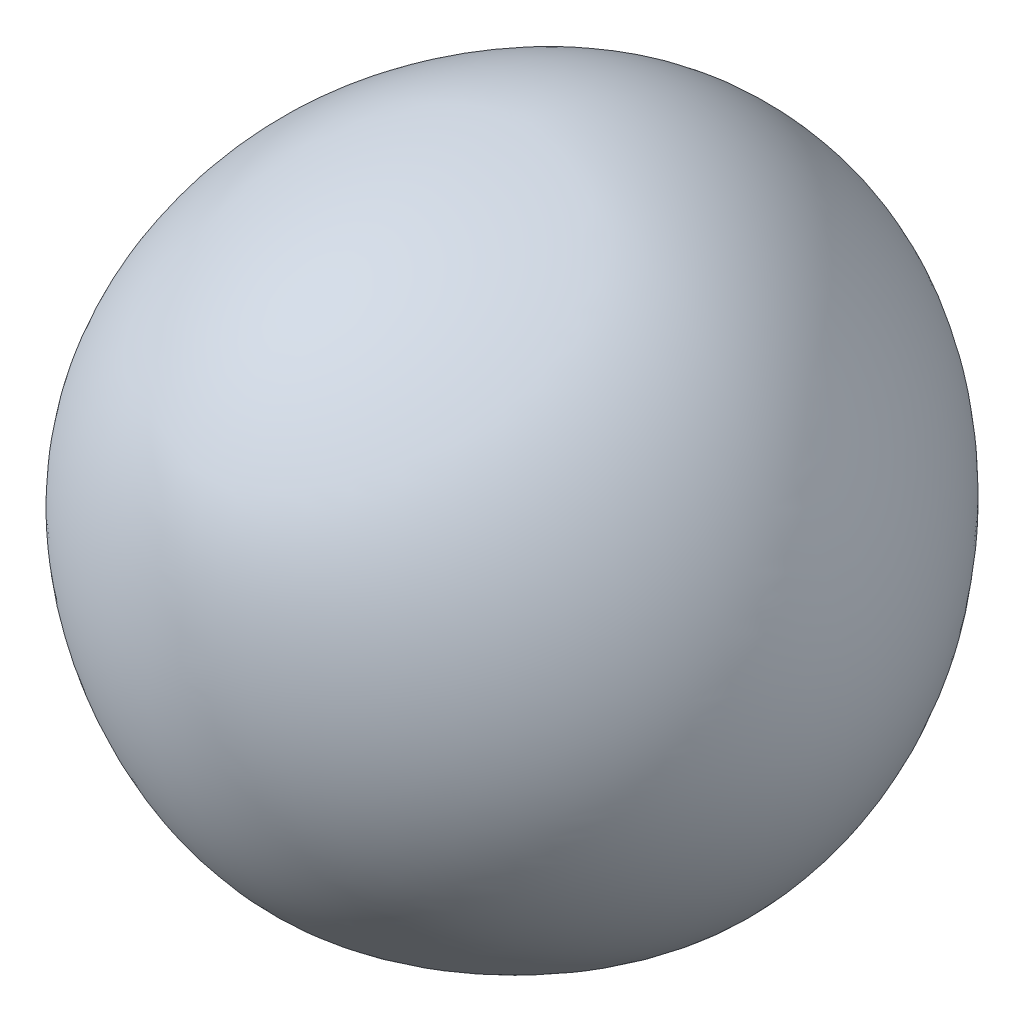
ISO-10303-21;
HEADER;
FILE_DESCRIPTION(('STEP AP214'),'2;1');
FILE_NAME('part.step','',(''),(''),'','','');
FILE_SCHEMA(('AUTOMOTIVE_DESIGN { 1 0 10303 214 1 1 1 1 }'));
ENDSEC;
DATA;
#1=APPLICATION_CONTEXT('core data for automotive mechanical design processes');
#2=APPLICATION_PROTOCOL_DEFINITION('international standard','automotive_design',2000,#1);
#3=PRODUCT_CONTEXT('',#1,'mechanical');
#4=PRODUCT('Part','Part','',(#3));
#5=PRODUCT_RELATED_PRODUCT_CATEGORY('part','',(#4));
#6=PRODUCT_DEFINITION_FORMATION('','',#4);
#7=PRODUCT_DEFINITION_CONTEXT('part definition',#1,'design');
#8=PRODUCT_DEFINITION('design','',#6,#7);
#9=PRODUCT_DEFINITION_SHAPE('','',#8);
#10=(LENGTH_UNIT() NAMED_UNIT(*) SI_UNIT(.MILLI.,.METRE.));
#11=(NAMED_UNIT(*) PLANE_ANGLE_UNIT() SI_UNIT($,.RADIAN.));
#12=(NAMED_UNIT(*) SI_UNIT($,.STERADIAN.) SOLID_ANGLE_UNIT());
#13=UNCERTAINTY_MEASURE_WITH_UNIT(LENGTH_MEASURE(1.E-05),#10,'distance_accuracy_value','');
#14=(GEOMETRIC_REPRESENTATION_CONTEXT(3) GLOBAL_UNCERTAINTY_ASSIGNED_CONTEXT((#13)) GLOBAL_UNIT_ASSIGNED_CONTEXT((#10,
#11,#12)) REPRESENTATION_CONTEXT('',''));
#15=CARTESIAN_POINT('',(0.,0.,0.));
#16=DIRECTION('',(0.,0.,1.));
#17=DIRECTION('',(1.,0.,0.));
#18=AXIS2_PLACEMENT_3D('',#15,#16,#17);
#19=CARTESIAN_POINT('',(0.,0.,-14.9999999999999));
#20=CARTESIAN_POINT('',(7.41762077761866,0.,-14.8763256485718));
#21=CARTESIAN_POINT('',(22.5986495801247,0.,-0.062978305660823));
#22=CARTESIAN_POINT('',(-0.424501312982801,0.,22.5175516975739));
#23=CARTESIAN_POINT('',(-22.3957778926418,0.,-0.0350986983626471));
#24=CARTESIAN_POINT('',(-7.60544900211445,0.,-15.126806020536));
#25=CARTESIAN_POINT('',(0.,0.,-14.9999999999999));
#26=CARTESIAN_POINT('',(0.,0.590036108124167,-17.5887729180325));
#27=CARTESIAN_POINT('',(8.70928177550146,0.5903703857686,-17.4437491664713));
#28=CARTESIAN_POINT('',(26.5384610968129,0.601608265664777,-0.0726637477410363));
#29=CARTESIAN_POINT('',(-0.500786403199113,0.583791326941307,26.3995538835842));
#30=CARTESIAN_POINT('',(-26.2907855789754,0.600144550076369,-0.0399409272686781));
#31=CARTESIAN_POINT('',(-8.92981730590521,0.589693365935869,-17.737468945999));
#32=CARTESIAN_POINT('',(0.,0.590036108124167,-17.5887729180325));
#33=CARTESIAN_POINT('',(0.,2.07577630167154,-22.6966503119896));
#34=CARTESIAN_POINT('',(11.2575769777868,2.07715829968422,-22.5095024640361));
#35=CARTESIAN_POINT('',(34.3112340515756,2.1233559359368,-0.0918098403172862));
#36=CARTESIAN_POINT('',(-0.651281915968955,2.05012696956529,34.0592135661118));
#37=CARTESIAN_POINT('',(-33.9751898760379,2.11729047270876,-0.0495318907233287));
#38=CARTESIAN_POINT('',(-11.5426401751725,2.07435930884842,-22.888537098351));
#39=CARTESIAN_POINT('',(0.,2.07577630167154,-22.6966503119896));
#40=CARTESIAN_POINT('',(0.,5.19614651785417,-30.0543246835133));
#41=CARTESIAN_POINT('',(14.9141514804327,5.19940973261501,-29.8065050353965));
#42=CARTESIAN_POINT('',(45.4587729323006,5.30827601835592,-0.120815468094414));
#43=CARTESIAN_POINT('',(-0.86431299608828,5.13569001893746,45.0976641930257));
#44=CARTESIAN_POINT('',(-45.0076147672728,5.29394247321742,-0.0648118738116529));
#45=CARTESIAN_POINT('',(-15.2918060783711,5.1928006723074,-30.3084195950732));
#46=CARTESIAN_POINT('',(0.,5.19614651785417,-30.0543246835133));
#47=CARTESIAN_POINT('',(0.,9.17582169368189,-37.0143550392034));
#48=CARTESIAN_POINT('',(18.3482006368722,9.179668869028,-36.7091534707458));
#49=CARTESIAN_POINT('',(55.9177649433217,9.30859772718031,-0.150789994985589));
#50=CARTESIAN_POINT('',(-1.05917887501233,9.10411369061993,55.5485150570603));
#51=CARTESIAN_POINT('',(-55.379339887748,9.29173018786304,-0.0818703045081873));
#52=CARTESIAN_POINT('',(-18.8128118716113,9.17187710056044,-37.3272848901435));
#53=CARTESIAN_POINT('',(0.,9.17582169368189,-37.0143550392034));
#54=CARTESIAN_POINT('',(0.,12.3755327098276,-41.3279788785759));
#55=CARTESIAN_POINT('',(20.4552481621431,12.3774764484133,-40.9872232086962));
#56=CARTESIAN_POINT('',(62.3265873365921,12.4431312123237,-0.171590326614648));
#57=CARTESIAN_POINT('',(-1.17435939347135,12.338915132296,62.0335098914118));
#58=CARTESIAN_POINT('',(-61.7521869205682,12.4346366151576,-0.0947249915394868));
#59=CARTESIAN_POINT('',(-20.9732138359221,12.3735397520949,-41.677363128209));
#60=CARTESIAN_POINT('',(0.,12.3755327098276,-41.3279788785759));
#61=CARTESIAN_POINT('',(0.,15.2263559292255,-44.7254576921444));
#62=CARTESIAN_POINT('',(22.1052657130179,15.2250942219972,-44.3567035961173));
#63=CARTESIAN_POINT('',(67.3415525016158,15.1824768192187,-0.189033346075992));
#64=CARTESIAN_POINT('',(-1.26263551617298,15.2501248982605,67.144945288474));
#65=CARTESIAN_POINT('',(-66.7466784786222,15.1879907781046,-0.105938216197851));
#66=CARTESIAN_POINT('',(-22.6650129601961,15.2276495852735,-45.1035493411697));
#67=CARTESIAN_POINT('',(0.,15.2263559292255,-44.7254576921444));
#68=CARTESIAN_POINT('',(0.,17.5599708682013,-47.3258060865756));
#69=CARTESIAN_POINT('',(23.3667894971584,17.5707590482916,-46.9355885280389));
#70=CARTESIAN_POINT('',(71.1256233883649,17.460055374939,-0.194427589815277));
#71=CARTESIAN_POINT('',(-1.30443962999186,17.6662279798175,71.0289753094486));
#72=CARTESIAN_POINT('',(-70.6180339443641,17.3875198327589,-0.106351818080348));
#73=CARTESIAN_POINT('',(-23.9584809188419,17.548909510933,-47.7259046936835));
#74=CARTESIAN_POINT('',(0.,17.5599708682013,-47.3258060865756));
#75=CARTESIAN_POINT('',(0.,21.3175232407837,-50.9799508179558));
#76=CARTESIAN_POINT('',(25.1470286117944,21.3670738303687,-50.5594511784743));
#77=CARTESIAN_POINT('',(76.3639457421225,21.1229357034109,-0.173925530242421));
#78=CARTESIAN_POINT('',(-1.31132503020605,21.6575494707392,76.3876950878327));
#79=CARTESIAN_POINT('',(-76.188342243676,20.8039020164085,-0.078100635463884));
#80=CARTESIAN_POINT('',(-25.7837990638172,21.266717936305,-51.4110983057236));
#81=CARTESIAN_POINT('',(0.,21.3175232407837,-50.9799508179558));
#82=CARTESIAN_POINT('',(0.,25.321375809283,-54.3642346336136));
#83=CARTESIAN_POINT('',(26.8087659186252,25.4178465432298,-53.9155457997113));
#84=CARTESIAN_POINT('',(81.1759065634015,24.984629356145,-0.121505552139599));
#85=CARTESIAN_POINT('',(-1.27795105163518,25.9915275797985,81.2324282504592));
#86=CARTESIAN_POINT('',(-81.4696850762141,24.3657479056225,-0.0176108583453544));
#87=CARTESIAN_POINT('',(-27.4876147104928,25.2224622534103,-54.8242851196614));
#88=CARTESIAN_POINT('',(0.,25.321375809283,-54.3642346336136));
#89=CARTESIAN_POINT('',(0.,30.9632872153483,-58.492397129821));
#90=CARTESIAN_POINT('',(28.8489054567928,31.1222228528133,-58.0091221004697));
#91=CARTESIAN_POINT('',(87.0099630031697,30.3796090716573,-0.0107454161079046));
#92=CARTESIAN_POINT('',(-1.19923253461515,32.1535004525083,86.9764672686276));
#93=CARTESIAN_POINT('',(-88.0312634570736,29.3584574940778,0.104243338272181));
#94=CARTESIAN_POINT('',(-29.5794144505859,30.8003270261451,-58.9879095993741));
#95=CARTESIAN_POINT('',(0.,30.9632872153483,-58.492397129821));
#96=CARTESIAN_POINT('',(0.,37.0229221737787,-62.0076336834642));
#97=CARTESIAN_POINT('',(30.5964190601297,37.2322042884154,-61.4945848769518));
#98=CARTESIAN_POINT('',(91.9297249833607,36.1460021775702,0.158779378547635));
#99=CARTESIAN_POINT('',(-1.09209676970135,38.771086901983,91.6016639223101));
#100=CARTESIAN_POINT('',(-93.7333183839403,34.7955876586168,0.285223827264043));
#101=CARTESIAN_POINT('',(-31.3711784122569,36.8083406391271,-62.5336738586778));
#102=CARTESIAN_POINT('',(0.,37.0229221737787,-62.0076336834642));
#103=CARTESIAN_POINT('',(0.,43.4076239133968,-64.8615292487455));
#104=CARTESIAN_POINT('',(31.9672538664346,43.6435705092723,-64.3240249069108));
#105=CARTESIAN_POINT('',(95.7759155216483,42.291931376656,0.362420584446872));
#106=CARTESIAN_POINT('',(-1.00133614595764,45.607041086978,95.1232334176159));
#107=CARTESIAN_POINT('',(-98.2200991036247,40.7626724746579,0.499928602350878));
#108=CARTESIAN_POINT('',(-32.7767253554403,43.1657027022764,-65.4126442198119));
#109=CARTESIAN_POINT('',(0.,43.4076239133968,-64.8615292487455));
#110=CARTESIAN_POINT('',(0.,48.3343912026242,-66.6631452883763));
#111=CARTESIAN_POINT('',(32.7832393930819,48.5806432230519,-66.1100651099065));
#112=CARTESIAN_POINT('',(98.0644608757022,47.0755959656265,0.523011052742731));
#113=CARTESIAN_POINT('',(-0.946855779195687,50.8073982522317,97.2330391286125));
#114=CARTESIAN_POINT('',(-100.891778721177,45.4745006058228,0.668358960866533));
#115=CARTESIAN_POINT('',(-33.6133731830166,48.0819036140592,-67.2302305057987));
#116=CARTESIAN_POINT('',(0.,48.3343912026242,-66.6631452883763));
#117=CARTESIAN_POINT('',(0.,53.375107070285,-68.1178205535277));
#118=CARTESIAN_POINT('',(33.3645642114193,53.6223030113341,-67.5520370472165));
#119=CARTESIAN_POINT('',(99.7064199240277,52.005416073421,0.682262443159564));
#120=CARTESIAN_POINT('',(-0.913962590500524,56.0490338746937,98.8319155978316));
#121=CARTESIAN_POINT('',(-102.782968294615,50.3925152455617,0.834730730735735));
#122=CARTESIAN_POINT('',(-34.2094182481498,53.1216516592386,-68.6979307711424));
#123=CARTESIAN_POINT('',(0.,53.375107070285,-68.1178205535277));
#124=CARTESIAN_POINT('',(0.,58.5062417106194,-69.2144759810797));
#125=CARTESIAN_POINT('',(33.6946508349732,58.7498914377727,-68.6390057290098));
#126=CARTESIAN_POINT('',(100.632436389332,57.0304745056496,0.827934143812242));
#127=CARTESIAN_POINT('',(-0.892048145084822,61.3291802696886,99.9466881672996));
#128=CARTESIAN_POINT('',(-103.863474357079,55.4339934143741,0.986454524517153));
#129=CARTESIAN_POINT('',(-34.5478632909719,58.2564223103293,-69.804518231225));
#130=CARTESIAN_POINT('',(0.,58.5062417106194,-69.2144759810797));
#131=CARTESIAN_POINT('',(0.,63.7029776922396,-69.945300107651));
#132=CARTESIAN_POINT('',(33.7629974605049,63.940018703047,-69.3632698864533));
#133=CARTESIAN_POINT('',(100.814999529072,62.076675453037,0.949388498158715));
#134=CARTESIAN_POINT('',(-0.88280926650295,66.651751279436,100.603369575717));
#135=CARTESIAN_POINT('',(-104.096865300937,60.5133136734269,1.11259316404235));
#136=CARTESIAN_POINT('',(-34.6179405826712,63.4599343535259,-70.5420684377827));
#137=CARTESIAN_POINT('',(0.,63.7029776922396,-69.945300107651));
#138=CARTESIAN_POINT('',(0.,68.9439829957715,-70.2541252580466));
#139=CARTESIAN_POINT('',(33.5905730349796,69.1742858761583,-69.6692692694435));
#140=CARTESIAN_POINT('',(100.351151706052,67.0724384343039,1.01322877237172));
#141=CARTESIAN_POINT('',(-0.904436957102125,72.0303700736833,100.83659363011));
#142=CARTESIAN_POINT('',(-103.511522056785,65.5379410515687,1.17874720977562));
#143=CARTESIAN_POINT('',(-34.4411500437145,68.7078484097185,-70.8537909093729));
#144=CARTESIAN_POINT('',(0.,68.9439829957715,-70.2541252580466));
#145=CARTESIAN_POINT('',(0.,74.1923900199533,-70.0589532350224));
#146=CARTESIAN_POINT('',(33.195778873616,74.4215842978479,-69.4758809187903));
#147=CARTESIAN_POINT('',(99.3202510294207,71.9721574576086,0.973386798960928));
#148=CARTESIAN_POINT('',(-0.969921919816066,77.4693992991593,100.687417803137));
#149=CARTESIAN_POINT('',(-102.138461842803,70.4259319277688,1.13745643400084));
#150=CARTESIAN_POINT('',(-34.0363589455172,73.9573921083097,-70.6567900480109));
#151=CARTESIAN_POINT('',(0.,74.1923900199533,-70.0589532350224));
#152=CARTESIAN_POINT('',(0.,79.3945161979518,-69.3310731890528));
#153=CARTESIAN_POINT('',(32.604506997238,79.6296324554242,-68.754704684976));
#154=CARTESIAN_POINT('',(97.7665416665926,76.7687718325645,0.812743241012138));
#155=CARTESIAN_POINT('',(-1.06299610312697,82.9523046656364,100.173715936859));
#156=CARTESIAN_POINT('',(-100.092349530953,75.1639902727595,0.971087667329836));
#157=CARTESIAN_POINT('',(-33.4301149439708,79.1534463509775,-69.9220364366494));
#158=CARTESIAN_POINT('',(0.,79.3945161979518,-69.3310731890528));
#159=CARTESIAN_POINT('',(0.,84.4947310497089,-68.0723859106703));
#160=CARTESIAN_POINT('',(31.8426494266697,84.7442351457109,-67.5075369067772));
#161=CARTESIAN_POINT('',(95.7342677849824,81.4594451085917,0.551978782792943));
#162=CARTESIAN_POINT('',(-1.16739145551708,88.4505068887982,99.2251701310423));
#163=CARTESIAN_POINT('',(-97.4878499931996,79.7431609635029,0.700877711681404));
#164=CARTESIAN_POINT('',(-32.6489656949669,84.238909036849,-68.6515379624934));
#165=CARTESIAN_POINT('',(0.,84.4947310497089,-68.0723859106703));
#166=CARTESIAN_POINT('',(0.,89.4416415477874,-66.3047627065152));
#167=CARTESIAN_POINT('',(30.9243055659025,89.7130989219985,-65.7559301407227));
#168=CARTESIAN_POINT('',(93.2470446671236,86.0561331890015,0.223258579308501));
#169=CARTESIAN_POINT('',(-1.27400447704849,93.9128693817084,97.7605270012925));
#170=CARTESIAN_POINT('',(-94.3879068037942,84.1843935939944,0.35989394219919));
#171=CARTESIAN_POINT('',(-31.7073676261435,89.163310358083,-66.8674927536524));
#172=CARTESIAN_POINT('',(0.,89.4416415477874,-66.3047627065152));
#173=CARTESIAN_POINT('',(0.,94.1953063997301,-64.069869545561));
#174=CARTESIAN_POINT('',(29.8635748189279,94.4953085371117,-63.5409516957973));
#175=CARTESIAN_POINT('',(90.3284875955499,90.5757066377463,-0.114139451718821));
#176=CARTESIAN_POINT('',(-1.37373166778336,99.2538525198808,95.6320624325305));
#177=CARTESIAN_POINT('',(-90.8554635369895,88.5136611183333,0.00907967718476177));
#178=CARTESIAN_POINT('',(-30.6197771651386,93.887707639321,-64.6121805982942));
#179=CARTESIAN_POINT('',(0.,94.1953063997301,-64.069869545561));
#180=CARTESIAN_POINT('',(0.,98.7301897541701,-61.4199872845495));
#181=CARTESIAN_POINT('',(28.6672353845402,99.0637723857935,-60.9142871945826));
#182=CARTESIAN_POINT('',(86.9860299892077,95.0271777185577,-0.422175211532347));
#183=CARTESIAN_POINT('',(-1.46018814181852,104.382581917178,92.7829429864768));
#184=CARTESIAN_POINT('',(-86.9249088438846,92.7515123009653,-0.312405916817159));
#185=CARTESIAN_POINT('',(-29.3931441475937,98.3881601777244,-61.9384926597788));
#186=CARTESIAN_POINT('',(0.,98.7301897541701,-61.4199872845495));
#187=CARTESIAN_POINT('',(0.,103.034681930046,-58.4113459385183));
#188=CARTESIAN_POINT('',(27.3420654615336,103.405186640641,-57.9315526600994));
#189=CARTESIAN_POINT('',(83.2271052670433,99.4141241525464,-0.666041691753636));
#190=CARTESIAN_POINT('',(-1.52698901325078,109.20670522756,89.1736396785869));
#191=CARTESIAN_POINT('',(-82.6306313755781,96.9128887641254,-0.568715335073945));
#192=CARTESIAN_POINT('',(-28.0344184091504,102.654795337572,-58.9032884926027));
#193=CARTESIAN_POINT('',(0.,103.034681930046,-58.4113459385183));
#194=CARTESIAN_POINT('',(0.,107.108801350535,-55.0979933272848));
#195=CARTESIAN_POINT('',(25.8891946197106,107.515457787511,-54.6462751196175));
#196=CARTESIAN_POINT('',(79.0386063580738,103.713386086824,-0.828448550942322));
#197=CARTESIAN_POINT('',(-1.56571910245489,113.647057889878,84.8233327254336));
#198=CARTESIAN_POINT('',(-77.9934743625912,100.999004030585,-0.741989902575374));
#199=CARTESIAN_POINT('',(-26.5447581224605,106.691847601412,-55.561149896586));
#200=CARTESIAN_POINT('',(0.,107.108801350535,-55.0979933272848));
#201=CARTESIAN_POINT('',(0.,110.959755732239,-51.5285214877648));
#202=CARTESIAN_POINT('',(24.3097524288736,111.397607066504,-51.1065823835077));
#203=CARTESIAN_POINT('',(74.4074261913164,107.898276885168,-0.89478183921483));
#204=CARTESIAN_POINT('',(-1.56796322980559,117.626263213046,79.7525591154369));
#205=CARTESIAN_POINT('',(-73.0342810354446,105.007436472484,-0.817129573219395));
#206=CARTESIAN_POINT('',(-24.9253214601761,110.510817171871,-51.9611448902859));
#207=CARTESIAN_POINT('',(0.,110.959755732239,-51.5285214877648));
#208=CARTESIAN_POINT('',(0.,114.601081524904,-47.7452136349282));
#209=CARTESIAN_POINT('',(22.6047072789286,115.060009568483,-47.3544271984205));
#210=CARTESIAN_POINT('',(69.3292436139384,111.910474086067,-0.869449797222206));
#211=CARTESIAN_POINT('',(-1.53005073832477,121.118686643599,74.0397562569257));
#212=CARTESIAN_POINT('',(-67.7636352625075,108.908172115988,-0.798576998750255));
#213=CARTESIAN_POINT('',(-23.1771013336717,114.130532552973,-48.1458955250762));
#214=CARTESIAN_POINT('',(0.,114.601081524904,-47.7452136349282));
#215=CARTESIAN_POINT('',(0.,118.003485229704,-43.7446203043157));
#216=CARTESIAN_POINT('',(20.7750275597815,118.468654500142,-43.3865037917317));
#217=CARTESIAN_POINT('',(63.7997374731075,115.712665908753,-0.779295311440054));
#218=CARTESIAN_POINT('',(-1.44831097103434,124.088042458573,67.7747345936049));
#219=CARTESIAN_POINT('',(-62.1921209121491,112.692853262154,-0.713898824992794));
#220=CARTESIAN_POINT('',(-21.3010906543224,117.526536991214,-44.1118050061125));
#221=CARTESIAN_POINT('',(0.,118.003485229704,-43.7446203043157));
#222=CARTESIAN_POINT('',(0.,121.134934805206,-39.5279473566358));
#223=CARTESIAN_POINT('',(18.8251299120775,121.588570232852,-39.2041278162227));
#224=CARTESIAN_POINT('',(57.8413814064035,119.253094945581,-0.652225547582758));
#225=CARTESIAN_POINT('',(-1.32761764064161,126.554979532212,61.0579879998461));
#226=CARTESIAN_POINT('',(-56.3235732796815,116.326978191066,-0.591745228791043));
#227=CARTESIAN_POINT('',(-19.3018179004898,120.66981246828,-39.8599666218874));
#228=CARTESIAN_POINT('',(0.,121.134934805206,-39.5279473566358));
#229=CARTESIAN_POINT('',(0.,123.962156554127,-35.1006587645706));
#230=CARTESIAN_POINT('',(16.7594309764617,124.383556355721,-34.8128288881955));
#231=CARTESIAN_POINT('',(51.4766490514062,122.480612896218,-0.514058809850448));
#232=CARTESIAN_POINT('',(-1.17284445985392,128.539837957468,53.9889514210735));
#233=CARTESIAN_POINT('',(-50.1618276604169,119.776673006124,-0.458613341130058));
#234=CARTESIAN_POINT('',(-17.1838115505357,123.530086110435,-35.3957770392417));
#235=CARTESIAN_POINT('',(0.,123.962156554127,-35.1006587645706));
#236=CARTESIAN_POINT('',(0.,127.286547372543,-28.9355817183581));
#237=CARTESIAN_POINT('',(13.862603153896,127.639272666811,-28.6979325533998));
#238=CARTESIAN_POINT('',(42.5123481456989,126.303652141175,-0.336683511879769));
#239=CARTESIAN_POINT('',(-0.935950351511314,130.612326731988,44.1983316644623));
#240=CARTESIAN_POINT('',(-41.5617228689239,124.054111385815,-0.288650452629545));
#241=CARTESIAN_POINT('',(-14.2136305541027,126.924890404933,-29.1792486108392));
#242=CARTESIAN_POINT('',(0.,127.286547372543,-28.9355817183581));
#243=CARTESIAN_POINT('',(0.,130.532278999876,-20.7807388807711));
#244=CARTESIAN_POINT('',(9.99646193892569,130.7545714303,-20.6097348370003));
#245=CARTESIAN_POINT('',(30.5304461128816,130.063871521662,-0.164674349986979));
#246=CARTESIAN_POINT('',(-0.610545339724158,132.255505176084,31.469260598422));
#247=CARTESIAN_POINT('',(-30.1029219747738,128.654249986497,-0.128118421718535));
#248=CARTESIAN_POINT('',(-10.2495913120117,130.304357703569,-20.9560730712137));
#249=CARTESIAN_POINT('',(0.,130.532278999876,-20.7807388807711));
#250=CARTESIAN_POINT('',(0.,132.83276068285,-10.5021876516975));
#251=CARTESIAN_POINT('',(5.07249062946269,132.887832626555,-10.4156491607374));
#252=CARTESIAN_POINT('',(15.4094289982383,132.747179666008,-0.0561166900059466));
#253=CARTESIAN_POINT('',(-0.267485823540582,133.162840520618,15.8080918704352));
#254=CARTESIAN_POINT('',(-15.3620893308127,132.399580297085,-0.0369180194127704));
#255=CARTESIAN_POINT('',(-5.2009357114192,132.776294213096,-10.590917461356));
#256=CARTESIAN_POINT('',(0.,132.83276068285,-10.5021876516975));
#257=CARTESIAN_POINT('',(0.,133.312232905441,-3.50005288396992));
#258=CARTESIAN_POINT('',(1.69077464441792,133.312232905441,-3.47121337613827));
#259=CARTESIAN_POINT('',(5.13514794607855,133.312232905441,-0.0189542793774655));
#260=CARTESIAN_POINT('',(-0.0885648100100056,133.312232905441,5.26923836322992));
#261=CARTESIAN_POINT('',(-5.12174971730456,133.312232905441,-0.0125626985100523));
#262=CARTESIAN_POINT('',(-1.73358826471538,133.312232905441,-3.52962266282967));
#263=CARTESIAN_POINT('',(0.,133.312232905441,-3.50005288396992));
#264=CARTESIAN_POINT('',(0.,133.312232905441,0.));
#265=CARTESIAN_POINT('',(0.,133.312232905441,0.));
#266=CARTESIAN_POINT('',(0.,133.312232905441,0.));
#267=CARTESIAN_POINT('',(0.,133.312232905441,0.));
#268=CARTESIAN_POINT('',(0.,133.312232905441,0.));
#269=CARTESIAN_POINT('',(0.,133.312232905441,0.));
#270=CARTESIAN_POINT('',(0.,133.312232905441,0.));
#271=B_SPLINE_SURFACE_WITH_KNOTS('',3,3,((#19,#20,#21,#22,#23,#24,#25),(#26,#27,#28,#29,#30,#31,
#32),(#33,#34,#35,#36,#37,#38,#39),(#40,#41,#42,#43,#44,#45,#46),(#47,#48,#49,#50,#51,#52,#53),
(#54,#55,#56,#57,#58,#59,#60),(#61,#62,#63,#64,#65,#66,#67),(#68,#69,#70,#71,#72,#73,#74),(#75,
#76,#77,#78,#79,#80,#81),(#82,#83,#84,#85,#86,#87,#88),(#89,#90,#91,#92,#93,#94,#95),(#96,#97,
#98,#99,#100,#101,#102),(#103,#104,#105,#106,#107,#108,#109),(#110,#111,#112,#113,#114,#115,
#116),(#117,#118,#119,#120,#121,#122,#123),(#124,#125,#126,#127,#128,#129,#130),(#131,#132,#133,
#134,#135,#136,#137),(#138,#139,#140,#141,#142,#143,#144),(#145,#146,#147,#148,#149,#150,#151),
(#152,#153,#154,#155,#156,#157,#158),(#159,#160,#161,#162,#163,#164,#165),(#166,#167,#168,#169,
#170,#171,#172),(#173,#174,#175,#176,#177,#178,#179),(#180,#181,#182,#183,#184,#185,#186),(#187,
#188,#189,#190,#191,#192,#193),(#194,#195,#196,#197,#198,#199,#200),(#201,#202,#203,#204,#205,
#206,#207),(#208,#209,#210,#211,#212,#213,#214),(#215,#216,#217,#218,#219,#220,#221),(#222,#223,
#224,#225,#226,#227,#228),(#229,#230,#231,#232,#233,#234,#235),(#236,#237,#238,#239,#240,#241,
#242),(#243,#244,#245,#246,#247,#248,#249),(#250,#251,#252,#253,#254,#255,#256),(#257,#258,#259,
#260,#261,#262,#263),(#264,#265,#266,#267,#268,#269,#270)),.UNSPECIFIED.,.F.,.T.,.F.,(4,1,1,1,2,
1,1,1,1,1,1,1,1,1,1,1,1,1,1,1,1,1,1,1,1,1,1,1,1,1,1,1,4),(4,1,1,1,4),(0.,0.04036875,0.0807375,
0.12110625,0.161475,0.18767890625,0.2138828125,0.24008671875,0.266290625,0.3186984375,
0.34490234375,0.37110625,0.39731015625,0.4235140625,0.44971796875,0.475921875,0.50212578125,
0.5283296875,0.55453359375,0.5807375,0.60694140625,0.6331453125,0.65934921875,0.685553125,
0.71175703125,0.7379609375,0.76416484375,0.79036875,0.81657265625,0.8427765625,0.895184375,
0.9475921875,1.),(0.,0.247319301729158,0.49323722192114,0.746418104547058,1.),.UNSPECIFIED.);
#272=CARTESIAN_POINT('',(-7.8709793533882E-12,0.,-15.));
#273=CARTESIAN_POINT('',(0.281221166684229,0.00106782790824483,-15.000008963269));
#274=CARTESIAN_POINT('',(0.562438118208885,0.00272743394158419,-14.9920917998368));
#275=CARTESIAN_POINT('',(1.12395854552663,0.00700129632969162,-14.9604718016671));
#276=CARTESIAN_POINT('',(1.4042620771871,0.00961549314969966,-14.9367699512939));
#277=CARTESIAN_POINT('',(1.96308041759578,0.0155697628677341,-14.8736477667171));
#278=CARTESIAN_POINT('',(2.24159526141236,0.0189098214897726,-14.8342277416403));
#279=CARTESIAN_POINT('',(2.79576567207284,0.0260867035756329,-14.7398317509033));
#280=CARTESIAN_POINT('',(3.07142312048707,0.0299231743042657,-14.6848667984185));
#281=CARTESIAN_POINT('',(3.61921400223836,0.0378780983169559,-14.5595407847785));
#282=CARTESIAN_POINT('',(3.89134746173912,0.0419965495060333,-14.4891798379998));
#283=CARTESIAN_POINT('',(4.4312153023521,0.0503127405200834,-14.3332931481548));
#284=CARTESIAN_POINT('',(4.69894970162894,0.0545104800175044,-14.247767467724));
#285=CARTESIAN_POINT('',(5.36191832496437,0.0648727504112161,-14.0152586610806));
#286=CARTESIAN_POINT('',(5.75392085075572,0.0709704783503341,-13.8589364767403));
#287=CARTESIAN_POINT('',(6.5233906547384,0.0823778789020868,-13.513816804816));
#288=CARTESIAN_POINT('',(6.90085602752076,0.087687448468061,-13.3250150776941));
#289=CARTESIAN_POINT('',(7.63846295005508,0.097086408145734,-12.9163302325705));
#290=CARTESIAN_POINT('',(7.99860914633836,0.101176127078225,-12.6964555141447));
#291=CARTESIAN_POINT('',(8.69911005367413,0.107826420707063,-12.227151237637));
#292=CARTESIAN_POINT('',(9.03946487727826,0.110387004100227,-11.9777218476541));
#293=CARTESIAN_POINT('',(9.69788663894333,0.113793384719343,-11.4511419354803));
#294=CARTESIAN_POINT('',(10.0159588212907,0.114639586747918,-11.1739979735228));
#295=CARTESIAN_POINT('',(10.627639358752,0.114560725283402,-10.5939108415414));
#296=CARTESIAN_POINT('',(10.9212475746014,0.113635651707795,-10.2909675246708));
#297=CARTESIAN_POINT('',(11.4819767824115,0.110084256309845,-9.66136412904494));
#298=CARTESIAN_POINT('',(11.7490913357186,0.107457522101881,-9.33469831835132));
#299=CARTESIAN_POINT('',(12.2548487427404,0.100699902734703,-8.66004704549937));
#300=CARTESIAN_POINT('',(12.4934920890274,0.0965690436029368,-8.31206195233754));
#301=CARTESIAN_POINT('',(12.9405185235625,0.0871262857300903,-7.59740391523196));
#302=CARTESIAN_POINT('',(13.148915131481,0.0818149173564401,-7.23073942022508));
#303=CARTESIAN_POINT('',(13.5341145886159,0.0704475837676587,-6.48115049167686));
#304=CARTESIAN_POINT('',(13.7109152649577,0.0643915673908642,-6.09822494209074));
#305=CARTESIAN_POINT('',(14.0315558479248,0.0520851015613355,-5.31909946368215));
#306=CARTESIAN_POINT('',(14.1754155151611,0.0458347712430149,-4.92290765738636));
#307=CARTESIAN_POINT('',(14.4292680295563,0.0337749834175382,-4.11988391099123));
#308=CARTESIAN_POINT('',(14.5392700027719,0.0279654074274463,-3.71305487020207));
#309=CARTESIAN_POINT('',(14.6889684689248,0.0195104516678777,-3.04980474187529));
#310=CARTESIAN_POINT('',(14.7394287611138,0.016507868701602,-2.7957648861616));
#311=CARTESIAN_POINT('',(14.8271405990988,0.0111083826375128,-2.28537438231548));
#312=CARTESIAN_POINT('',(14.8643912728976,0.00871151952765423,-2.02902358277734));
#313=CARTESIAN_POINT('',(14.9255227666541,0.0046999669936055,-1.51512958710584));
#314=CARTESIAN_POINT('',(14.949424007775,0.00308408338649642,-1.25758882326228));
#315=CARTESIAN_POINT('',(14.9838875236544,0.000794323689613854,-0.741626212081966));
#316=CARTESIAN_POINT('',(14.9944505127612,0.000120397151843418,-0.483204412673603));
#317=CARTESIAN_POINT('',(14.9983172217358,0.,-0.224678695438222));
#318=B_SPLINE_CURVE_WITH_KNOTS('',3,(#272,#273,#274,#275,#276,#277,#278,#279,#280,#281,#282,
#283,#284,#285,#286,#287,#288,#289,#290,#291,#292,#293,#294,#295,#296,#297,#298,#299,#300,#301,
#302,#303,#304,#305,#306,#307,#308,#309,#310,#311,#312,#313,#314,#315,#316,#317),.UNSPECIFIED.,
.F.,.F.,(4,2,2,2,2,2,2,2,2,2,2,2,2,2,2,2,2,2,2,2,2,2,4),(0.,0.843554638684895,1.6870566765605,
2.53054212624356,3.37343147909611,4.21631457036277,5.05919418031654,6.32380197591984,
7.58857496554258,8.85300671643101,10.1174312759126,11.3815572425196,12.6456904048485,
13.9101300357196,15.1745477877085,16.4383986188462,17.7023363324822,18.965513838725,
20.2283505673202,21.0051032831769,21.7819072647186,22.557519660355,23.333090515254),.UNSPECIFIED.);
#319=CARTESIAN_POINT('',(-0.000242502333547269,-1.06986367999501E-06,-14.999999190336));
#320=VERTEX_POINT('',#319);
#321=CARTESIAN_POINT('',(14.9983062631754,3.66197542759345E-05,-0.224678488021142));
#322=VERTEX_POINT('',#321);
#323=EDGE_CURVE('E141',#320,#322,#318,.T.);
#324=CARTESIAN_POINT('',(-1.66470167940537,-1.98801752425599E-05,-14.9073440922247));
#325=CARTESIAN_POINT('',(-1.59612334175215,-6.97176858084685E-06,-14.9160473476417));
#326=CARTESIAN_POINT('',(-1.52747281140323,-1.21328266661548E-06,-14.9241647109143));
#327=CARTESIAN_POINT('',(-1.43979857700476,1.59580963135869E-06,-14.9337646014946));
#328=CARTESIAN_POINT('',(-1.42083480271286,1.93249620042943E-06,-14.9357953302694));
#329=CARTESIAN_POINT('',(-1.35134178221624,2.4505056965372E-06,-14.9430690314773));
#330=CARTESIAN_POINT('',(-1.30078337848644,1.44157648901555E-06,-14.9480357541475));
#331=CARTESIAN_POINT('',(-1.18049150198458,1.61691931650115E-06,-14.9590734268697));
#332=CARTESIAN_POINT('',(-1.11073109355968,3.7739548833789E-06,-14.9648524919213));
#333=CARTESIAN_POINT('',(-0.971334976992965,1.08946020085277E-05,-14.9751473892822));
#334=CARTESIAN_POINT('',(-0.901699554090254,1.58494795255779E-05,-14.9796670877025));
#335=CARTESIAN_POINT('',(-0.76255330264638,2.55553050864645E-05,-14.9874435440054));
#336=CARTESIAN_POINT('',(-0.693042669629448,3.03067842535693E-05,-14.9907037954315));
#337=CARTESIAN_POINT('',(-0.554146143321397,3.51768418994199E-05,-14.9959617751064));
#338=CARTESIAN_POINT('',(-0.484760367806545,3.53068726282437E-05,-14.997962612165));
#339=CARTESIAN_POINT('',(-0.346113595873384,2.81494070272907E-05,-15.000702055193));
#340=CARTESIAN_POINT('',(-0.27685265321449,2.0877913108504E-05,-15.0014433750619));
#341=CARTESIAN_POINT('',(-0.138455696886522,7.11613626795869E-06,-15.001664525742));
#342=CARTESIAN_POINT('',(-0.0693196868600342,6.24446237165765E-07,-15.0011466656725));
#343=CARTESIAN_POINT('',(-0.000194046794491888,-1.42582763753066E-06,-14.9999967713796));
#344=B_SPLINE_CURVE_WITH_KNOTS('',3,(#324,#325,#326,#327,#328,#329,#330,#331,#332,#333,#334,
#335,#336,#337,#338,#339,#340,#341,#342,#343),.UNSPECIFIED.,.F.,.F.,(4,2,2,2,2,2,2,2,2,4),(0.,
0.207378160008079,0.264594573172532,0.416995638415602,0.626982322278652,0.836317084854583,
1.04506693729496,1.2532994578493,1.46108272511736,1.66848524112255),.UNSPECIFIED.);
#345=CARTESIAN_POINT('',(-1.66470107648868,-4.37053473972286E-06,-14.9073393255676));
#346=VERTEX_POINT('',#345);
#347=EDGE_CURVE('E207',#346,#320,#344,.T.);
#348=CARTESIAN_POINT('',(-1.98410938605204,0.,14.8681979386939));
#349=CARTESIAN_POINT('',(-2.26287717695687,0.00119486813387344,14.8310063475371));
#350=CARTESIAN_POINT('',(-2.54059313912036,0.00280711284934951,14.7859578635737));
#351=CARTESIAN_POINT('',(-3.09303609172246,0.00668090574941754,14.6803317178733));
#352=CARTESIAN_POINT('',(-3.36776324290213,0.00894241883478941,14.6197548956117));
#353=CARTESIAN_POINT('',(-3.91336876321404,0.0139294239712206,14.4832538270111));
#354=CARTESIAN_POINT('',(-4.18424720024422,0.0166549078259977,14.4073298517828));
#355=CARTESIAN_POINT('',(-4.72112535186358,0.0223869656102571,14.2404334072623));
#356=CARTESIAN_POINT('',(-4.98712819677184,0.0253933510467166,14.1494709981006));
#357=CARTESIAN_POINT('',(-5.51360447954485,0.0315174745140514,13.9527462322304));
#358=CARTESIAN_POINT('',(-5.77407796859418,0.0346352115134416,13.8469840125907));
#359=CARTESIAN_POINT('',(-6.28865750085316,0.0408240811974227,13.621004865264));
#360=CARTESIAN_POINT('',(-6.54276357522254,0.0438952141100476,13.5007880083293));
#361=CARTESIAN_POINT('',(-7.16924404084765,0.051337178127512,13.1825507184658));
#362=CARTESIAN_POINT('',(-7.5371781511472,0.0555894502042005,12.9756976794));
#363=CARTESIAN_POINT('',(-8.25433264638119,0.0632600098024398,12.5317166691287));
#364=CARTESIAN_POINT('',(-8.60355057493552,0.066678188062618,12.2945847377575));
#365=CARTESIAN_POINT('',(-9.28068704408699,0.0723790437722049,11.7918023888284));
#366=CARTESIAN_POINT('',(-9.60861149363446,0.0746620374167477,11.5261599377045));
#367=CARTESIAN_POINT('',(-10.2409200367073,0.0779028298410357,10.9681970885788));
#368=CARTESIAN_POINT('',(-10.5453042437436,0.0788606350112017,10.675876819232));
#369=CARTESIAN_POINT('',(-11.1282770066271,0.0793743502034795,10.0667333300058));
#370=CARTESIAN_POINT('',(-11.4068737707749,0.0789307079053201,9.74991796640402));
#371=CARTESIAN_POINT('',(-11.936399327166,0.0766815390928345,9.09395639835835));
#372=CARTESIAN_POINT('',(-12.1873280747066,0.0748760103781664,8.7548101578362));
#373=CARTESIAN_POINT('',(-12.6597734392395,0.0700569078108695,8.05654155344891));
#374=CARTESIAN_POINT('',(-12.8812851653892,0.0670431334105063,7.69741588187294));
#375=CARTESIAN_POINT('',(-13.2932747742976,0.0600743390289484,6.96179323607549));
#376=CARTESIAN_POINT('',(-13.4837526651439,0.0561193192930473,6.58529626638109));
#377=CARTESIAN_POINT('',(-13.8322980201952,0.0476423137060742,5.81766204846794));
#378=CARTESIAN_POINT('',(-13.9903703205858,0.0431204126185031,5.42652699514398));
#379=CARTESIAN_POINT('',(-14.2730203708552,0.0339803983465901,4.63233708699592));
#380=CARTESIAN_POINT('',(-14.3975980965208,0.0293622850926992,4.22928222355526));
#381=CARTESIAN_POINT('',(-14.6123668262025,0.0205833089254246,3.41414208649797));
#382=CARTESIAN_POINT('',(-14.702560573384,0.0164224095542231,3.00205753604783));
#383=CARTESIAN_POINT('',(-14.8479339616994,0.00917369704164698,2.17174887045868));
#384=CARTESIAN_POINT('',(-14.9031136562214,0.00608588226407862,1.75352476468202));
#385=CARTESIAN_POINT('',(-14.9780834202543,0.00161287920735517,0.9136950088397));
#386=CARTESIAN_POINT('',(-14.9978557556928,0.000228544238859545,0.492087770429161));
#387=CARTESIAN_POINT('',(-15.0018138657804,-0.000179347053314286,-0.351295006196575));
#388=CARTESIAN_POINT('',(-14.9859996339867,0.000797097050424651,-0.773070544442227));
#389=CARTESIAN_POINT('',(-14.9188976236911,0.00456526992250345,-1.61379350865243));
#390=CARTESIAN_POINT('',(-14.8676087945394,0.00735705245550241,-2.03274085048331));
#391=CARTESIAN_POINT('',(-14.7299236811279,0.0141169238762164,-2.8648168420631));
#392=CARTESIAN_POINT('',(-14.6435273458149,0.018085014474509,-3.27794548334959));
#393=CARTESIAN_POINT('',(-14.4363545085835,0.0265847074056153,-4.09500993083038));
#394=CARTESIAN_POINT('',(-14.3156151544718,0.0311156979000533,-4.49895516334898));
#395=CARTESIAN_POINT('',(-14.0405745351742,0.0401856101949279,-5.2952526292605));
#396=CARTESIAN_POINT('',(-13.8862733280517,0.0447245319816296,-5.68760488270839));
#397=CARTESIAN_POINT('',(-13.5452026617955,0.0533288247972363,-6.45793442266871));
#398=CARTESIAN_POINT('',(-13.3584335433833,0.0573942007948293,-6.83591185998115));
#399=CARTESIAN_POINT('',(-12.9537481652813,0.0646626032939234,-7.57481656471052));
#400=CARTESIAN_POINT('',(-12.7358319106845,0.067865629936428,-7.93574383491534));
#401=CARTESIAN_POINT('',(-12.2701485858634,0.0731268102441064,-8.63836065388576));
#402=CARTESIAN_POINT('',(-12.022350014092,0.0751837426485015,-8.98002933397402));
#403=CARTESIAN_POINT('',(-11.4988475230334,0.0779716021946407,-9.6412828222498));
#404=CARTESIAN_POINT('',(-11.2231434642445,0.0787025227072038,-9.96086752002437));
#405=CARTESIAN_POINT('',(-10.6457651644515,0.0787763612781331,-10.5757055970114));
#406=CARTESIAN_POINT('',(-10.3440883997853,0.0781191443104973,-10.8709566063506));
#407=CARTESIAN_POINT('',(-9.71694230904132,0.075469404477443,-11.4349853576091));
#408=CARTESIAN_POINT('',(-9.39147341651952,0.0734769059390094,-11.7037635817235));
#409=CARTESIAN_POINT('',(-8.71918713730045,0.0683242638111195,-12.2128409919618));
#410=CARTESIAN_POINT('',(-8.37237820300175,0.0651645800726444,-12.4531513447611));
#411=CARTESIAN_POINT('',(-7.65976412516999,0.0579537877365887,-12.9037099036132));
#412=CARTESIAN_POINT('',(-7.29395892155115,0.053902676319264,-13.1139580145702));
#413=CARTESIAN_POINT('',(-6.54613721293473,0.0452906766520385,-13.5027987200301));
#414=CARTESIAN_POINT('',(-6.16412948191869,0.0407300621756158,-13.681408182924));
#415=CARTESIAN_POINT('',(-5.38658885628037,0.0315706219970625,-14.0057893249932));
#416=CARTESIAN_POINT('',(-4.9910598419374,0.02697180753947,-14.1515703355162));
#417=CARTESIAN_POINT('',(-4.11409052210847,0.0174678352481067,-14.4334320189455));
#418=CARTESIAN_POINT('',(-3.63040005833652,0.0126658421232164,-14.5626175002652));
#419=CARTESIAN_POINT('',(-2.89760782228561,0.00675667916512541,-14.7195876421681));
#420=CARTESIAN_POINT('',(-2.65230215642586,0.00500334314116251,-14.7657575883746));
#421=CARTESIAN_POINT('',(-2.15969547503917,0.00205284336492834,-14.845805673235));
#422=CARTESIAN_POINT('',(-1.91239450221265,0.000855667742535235,-14.8796840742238));
#423=CARTESIAN_POINT('',(-1.66435378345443,0.,-14.907378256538));
#424=B_SPLINE_CURVE_WITH_KNOTS('',3,(#348,#349,#350,#351,#352,#353,#354,#355,#356,#357,#358,
#359,#360,#361,#362,#363,#364,#365,#366,#367,#368,#369,#370,#371,#372,#373,#374,#375,#376,#377,
#378,#379,#380,#381,#382,#383,#384,#385,#386,#387,#388,#389,#390,#391,#392,#393,#394,#395,#396,
#397,#398,#399,#400,#401,#402,#403,#404,#405,#406,#407,#408,#409,#410,#411,#412,#413,#414,#415,
#416,#417,#418,#419,#420,#421,#422,#423),.UNSPECIFIED.,.F.,.F.,(4,2,2,2,2,2,2,2,2,2,2,2,2,2,2,2,
2,2,2,2,2,2,2,2,2,2,2,2,2,2,2,2,2,2,2,2,2,4),(0.,0.843606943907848,1.68716829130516,
2.53071473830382,3.37369915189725,4.21667575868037,5.05964823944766,6.32440414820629,
7.58932564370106,8.85389460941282,10.1184574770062,11.3826164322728,12.6467774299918,
13.9111483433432,15.175518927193,16.4397006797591,17.7038833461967,18.9679651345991,
20.2320449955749,21.496757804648,22.7614708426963,24.0262213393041,25.2909736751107,
26.5543631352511,27.8177504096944,29.0811244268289,30.3444982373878,31.6092157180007,
32.8739395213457,34.1387863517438,35.4036101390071,36.6679361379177,37.9322661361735,
39.1959200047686,40.4592142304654,41.9584179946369,42.7070110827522,43.455588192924),.UNSPECIFIED.);
#425=CARTESIAN_POINT('',(-1.9865052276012,7.51485048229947E-06,14.8678666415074));
#426=VERTEX_POINT('',#425);
#427=EDGE_CURVE('E210',#426,#346,#424,.T.);
#428=CARTESIAN_POINT('',(0.,0.,-14.9999999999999));
#429=CARTESIAN_POINT('',(-7.60544900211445,0.,-15.126806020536));
#430=CARTESIAN_POINT('',(-22.3957778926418,0.,-0.0350986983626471));
#431=CARTESIAN_POINT('',(-0.424501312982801,0.,22.5175516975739));
#432=CARTESIAN_POINT('',(22.5986495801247,0.,-0.062978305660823));
#433=CARTESIAN_POINT('',(7.41762077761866,0.,-14.8763256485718));
#434=CARTESIAN_POINT('',(0.,0.,-14.9999999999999));
#435=B_SPLINE_CURVE_WITH_KNOTS('',3,(#428,#429,#430,#431,#432,#433,#434),.UNSPECIFIED.,.T.,.F.,
(4,1,1,1,4),(0.,0.253581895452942,0.50676277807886,0.752680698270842,1.),.UNSPECIFIED.);
#436=CARTESIAN_POINT('',(-1.98412916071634,0.000108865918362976,14.8682065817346));
#437=VERTEX_POINT('',#436);
#438=EDGE_CURVE('E209',#437,#426,#435,.F.);
#439=CARTESIAN_POINT('',(0.0763691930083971,0.000271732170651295,14.9998055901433));
#440=CARTESIAN_POINT('',(-0.00983624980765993,0.000288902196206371,15.0020606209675));
#441=CARTESIAN_POINT('',(-0.096068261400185,0.000258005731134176,15.0033378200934));
#442=CARTESIAN_POINT('',(-0.268430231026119,0.00016663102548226,15.0039278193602));
#443=CARTESIAN_POINT('',(-0.354560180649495,0.000106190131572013,15.0032430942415));
#444=CARTESIAN_POINT('',(-0.496693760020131,3.669636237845E-05,15.0004891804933));
#445=CARTESIAN_POINT('',(-0.552708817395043,1.70671797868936E-05,14.9989873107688));
#446=CARTESIAN_POINT('',(-0.63848266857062,7.8773981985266E-06,14.9960527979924));
#447=CARTESIAN_POINT('',(-0.668251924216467,8.54002467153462E-06,14.9949171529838));
#448=CARTESIAN_POINT('',(-0.783476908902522,4.57890543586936E-06,14.9900738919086));
#449=CARTESIAN_POINT('',(-0.868899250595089,-1.22568353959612E-05,14.9855299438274));
#450=CARTESIAN_POINT('',(-1.0399061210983,-3.86931056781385E-05,14.9745368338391));
#451=CARTESIAN_POINT('',(-1.12549024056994,-4.82693158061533E-05,14.9680813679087));
#452=CARTESIAN_POINT('',(-1.29682231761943,-5.51896597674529E-05,14.9532669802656));
#453=CARTESIAN_POINT('',(-1.38256965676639,-5.24870426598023E-05,14.9449008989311));
#454=CARTESIAN_POINT('',(-1.55422789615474,-3.70172267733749E-05,14.9262657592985));
#455=CARTESIAN_POINT('',(-1.64013792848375,-2.42070504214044E-05,14.9159887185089));
#456=CARTESIAN_POINT('',(-1.81212231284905,-1.53072007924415E-06,14.8935330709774));
#457=CARTESIAN_POINT('',(-1.89819552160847,8.32122940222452E-06,14.8813457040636));
#458=CARTESIAN_POINT('',(-1.98412822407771,1.00092613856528E-05,14.8682407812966));
#459=B_SPLINE_CURVE_WITH_KNOTS('',3,(#439,#440,#441,#442,#443,#444,#445,#446,#447,#448,#449,
#450,#451,#452,#453,#454,#455,#456,#457,#458),.UNSPECIFIED.,.F.,.F.,(4,2,2,2,2,2,2,2,2,4),(0.,
0.258701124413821,0.517076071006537,0.685175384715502,0.774547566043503,1.03115322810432,
1.28861476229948,1.54705738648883,1.8066048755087,2.06737940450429),.UNSPECIFIED.);
#460=CARTESIAN_POINT('',(0.0763695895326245,0.000203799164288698,14.9998208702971));
#461=VERTEX_POINT('',#460);
#462=EDGE_CURVE('E163',#461,#437,#459,.T.);
#463=CARTESIAN_POINT('',(0.,0.,-14.9999999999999));
#464=CARTESIAN_POINT('',(-7.60544900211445,0.,-15.126806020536));
#465=CARTESIAN_POINT('',(-22.3957778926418,0.,-0.0350986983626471));
#466=CARTESIAN_POINT('',(-0.424501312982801,0.,22.5175516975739));
#467=CARTESIAN_POINT('',(22.5986495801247,0.,-0.062978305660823));
#468=CARTESIAN_POINT('',(7.41762077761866,0.,-14.8763256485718));
#469=CARTESIAN_POINT('',(0.,0.,-14.9999999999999));
#470=B_SPLINE_CURVE_WITH_KNOTS('',3,(#463,#464,#465,#466,#467,#468,#469),.UNSPECIFIED.,.T.,.F.,
(4,1,1,1,4),(0.,0.253581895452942,0.50676277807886,0.752680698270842,1.),.UNSPECIFIED.);
#471=CARTESIAN_POINT('',(0.0792624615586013,6.78970139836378E-05,14.9997753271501));
#472=VERTEX_POINT('',#471);
#473=EDGE_CURVE('E152',#472,#461,#470,.F.);
#474=CARTESIAN_POINT('',(14.9999034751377,0.,-0.0538120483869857));
#475=CARTESIAN_POINT('',(15.0009211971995,0.000130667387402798,0.227354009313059));
#476=CARTESIAN_POINT('',(14.9940156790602,0.000949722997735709,0.50854606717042));
#477=CARTESIAN_POINT('',(14.9644215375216,0.00374336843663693,1.07007344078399));
#478=CARTESIAN_POINT('',(14.9417340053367,0.0057178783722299,1.35040881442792));
#479=CARTESIAN_POINT('',(14.8806399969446,0.010601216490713,1.90934713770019));
#480=CARTESIAN_POINT('',(14.842233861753,0.0135100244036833,2.18795012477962));
#481=CARTESIAN_POINT('',(14.7498629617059,0.0200294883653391,2.74234455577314));
#482=CARTESIAN_POINT('',(14.6959096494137,0.0236396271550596,3.01813791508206));
#483=CARTESIAN_POINT('',(14.5726016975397,0.0313371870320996,3.5662560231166));
#484=CARTESIAN_POINT('',(14.5032471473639,0.0354246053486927,3.83858079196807));
#485=CARTESIAN_POINT('',(14.3493651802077,0.0438593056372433,4.3788860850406));
#486=CARTESIAN_POINT('',(14.2648378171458,0.0482065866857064,4.64686662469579));
#487=CARTESIAN_POINT('',(14.0348157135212,0.05914566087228,5.31050796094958));
#488=CARTESIAN_POINT('',(13.8799762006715,0.0657722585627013,5.70297163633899));
#489=CARTESIAN_POINT('',(13.5377883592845,0.0785296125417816,6.47348870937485));
#490=CARTESIAN_POINT('',(13.3504357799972,0.084660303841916,6.85154021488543));
#491=CARTESIAN_POINT('',(12.9445995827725,0.0959108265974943,7.59045117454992));
#492=CARTESIAN_POINT('',(12.7261238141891,0.10103091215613,7.9513149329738));
#493=CARTESIAN_POINT('',(12.2595580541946,0.109863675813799,8.65337421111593));
#494=CARTESIAN_POINT('',(12.0114682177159,0.113576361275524,8.9945698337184));
#495=CARTESIAN_POINT('',(11.4873726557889,0.119319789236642,9.65494698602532));
#496=CARTESIAN_POINT('',(11.2113604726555,0.121350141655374,9.97412339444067));
#497=CARTESIAN_POINT('',(10.6334307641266,0.123579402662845,10.5881015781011));
#498=CARTESIAN_POINT('',(10.3315130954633,0.123778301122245,10.8829032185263));
#499=CARTESIAN_POINT('',(9.70386008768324,0.122326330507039,11.4460873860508));
#500=CARTESIAN_POINT('',(9.37811987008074,0.120675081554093,11.7144644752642));
#501=CARTESIAN_POINT('',(8.70520457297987,0.115634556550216,12.2228155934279));
#502=CARTESIAN_POINT('',(8.35802983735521,0.112245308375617,12.4627900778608));
#503=CARTESIAN_POINT('',(7.64502921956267,0.103973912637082,12.9124360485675));
#504=CARTESIAN_POINT('',(7.27922014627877,0.0990930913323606,13.1221342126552));
#505=CARTESIAN_POINT('',(6.5312474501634,0.0882035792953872,13.5100077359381));
#506=CARTESIAN_POINT('',(6.14908282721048,0.0821948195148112,13.6881811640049));
#507=CARTESIAN_POINT('',(5.37130409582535,0.0695384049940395,14.0116506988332));
#508=CARTESIAN_POINT('',(4.97569684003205,0.0628910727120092,14.156963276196));
#509=CARTESIAN_POINT('',(4.17381762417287,0.0495536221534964,14.4137627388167));
#510=CARTESIAN_POINT('',(3.76754825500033,0.0428635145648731,14.5252577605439));
#511=CARTESIAN_POINT('',(2.81975048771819,0.0281504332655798,14.7428876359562));
#512=CARTESIAN_POINT('',(2.27530131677,0.0203563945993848,14.8366672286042));
#513=CARTESIAN_POINT('',(1.45406236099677,0.0107956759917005,14.9319018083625));
#514=CARTESIAN_POINT('',(1.17971436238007,0.00796484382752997,14.9560733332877));
#515=CARTESIAN_POINT('',(0.630035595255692,0.00323090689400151,14.9892903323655));
#516=CARTESIAN_POINT('',(0.354704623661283,0.00132800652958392,14.9983324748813));
#517=CARTESIAN_POINT('',(0.079262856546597,0.,14.9997905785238));
#518=B_SPLINE_CURVE_WITH_KNOTS('',3,(#474,#475,#476,#477,#478,#479,#480,#481,#482,#483,#484,
#485,#486,#487,#488,#489,#490,#491,#492,#493,#494,#495,#496,#497,#498,#499,#500,#501,#502,#503,
#504,#505,#506,#507,#508,#509,#510,#511,#512,#513,#514,#515,#516,#517),.UNSPECIFIED.,.F.,.F.,(4,
2,2,2,2,2,2,2,2,2,2,2,2,2,2,2,2,2,2,2,2,4),(0.,0.843388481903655,1.68671865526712,
2.53003053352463,3.37272278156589,4.21541013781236,5.05809449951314,6.32237385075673,
7.58681861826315,8.85094505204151,10.1150648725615,11.3794777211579,12.6438975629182,
13.9085770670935,15.1732362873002,16.4367742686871,17.7003896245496,18.9633702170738,
20.2260466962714,21.879795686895,22.7057201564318,23.5318264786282),.UNSPECIFIED.);
#519=CARTESIAN_POINT('',(14.9998938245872,2.14311426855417E-05,-0.0538120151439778));
#520=VERTEX_POINT('',#519);
#521=EDGE_CURVE('E150',#520,#472,#518,.T.);
#522=CARTESIAN_POINT('',(0.,0.,-14.9999999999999));
#523=CARTESIAN_POINT('',(-7.60544900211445,0.,-15.126806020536));
#524=CARTESIAN_POINT('',(-22.3957778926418,0.,-0.0350986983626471));
#525=CARTESIAN_POINT('',(-0.424501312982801,0.,22.5175516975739));
#526=CARTESIAN_POINT('',(22.5986495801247,0.,-0.062978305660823));
#527=CARTESIAN_POINT('',(7.41762077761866,0.,-14.8763256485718));
#528=CARTESIAN_POINT('',(0.,0.,-14.9999999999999));
#529=B_SPLINE_CURVE_WITH_KNOTS('',3,(#522,#523,#524,#525,#526,#527,#528),.UNSPECIFIED.,.T.,.F.,
(4,1,1,1,4),(0.,0.253581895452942,0.50676277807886,0.752680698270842,1.),.UNSPECIFIED.);
#530=CARTESIAN_POINT('',(14.9994003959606,0.000190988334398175,-0.137821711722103));
#531=VERTEX_POINT('',#530);
#532=EDGE_CURVE('E137',#531,#520,#529,.F.);
#533=CARTESIAN_POINT('',(0.,0.,-14.9999999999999));
#534=CARTESIAN_POINT('',(-7.60544900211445,0.,-15.126806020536));
#535=CARTESIAN_POINT('',(-22.3957778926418,0.,-0.0350986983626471));
#536=CARTESIAN_POINT('',(-0.424501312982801,0.,22.5175516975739));
#537=CARTESIAN_POINT('',(22.5986495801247,0.,-0.062978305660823));
#538=CARTESIAN_POINT('',(7.41762077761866,0.,-14.8763256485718));
#539=CARTESIAN_POINT('',(0.,0.,-14.9999999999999));
#540=B_SPLINE_CURVE_WITH_KNOTS('',3,(#533,#534,#535,#536,#537,#538,#539),.UNSPECIFIED.,.T.,.F.,
(4,1,1,1,4),(0.,0.253581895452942,0.50676277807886,0.752680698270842,1.),.UNSPECIFIED.);
#541=EDGE_CURVE('E133',#322,#531,#540,.F.);
#542=ORIENTED_EDGE('',*,*,#323,.F.);
#543=ORIENTED_EDGE('',*,*,#347,.F.);
#544=ORIENTED_EDGE('',*,*,#427,.F.);
#545=ORIENTED_EDGE('',*,*,#438,.F.);
#546=ORIENTED_EDGE('',*,*,#462,.F.);
#547=ORIENTED_EDGE('',*,*,#473,.F.);
#548=ORIENTED_EDGE('',*,*,#521,.F.);
#549=ORIENTED_EDGE('',*,*,#532,.F.);
#550=ORIENTED_EDGE('',*,*,#541,.F.);
#551=EDGE_LOOP('',(#542,#543,#544,#545,#546,#547,#548,#549,#550));
#552=FACE_BOUND('',#551,.T.);
#553=CARTESIAN_POINT('',(0.,133.312232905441,0.));
#554=VERTEX_POINT('',#553);
#555=VERTEX_LOOP('',#554);
#556=FACE_BOUND('',#555,.T.);
#557=ADVANCED_FACE('F80',(#552,#556),#271,.T.);
#558=CARTESIAN_POINT('',(20.9430520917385,-32.6812085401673,-0.608552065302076));
#559=CARTESIAN_POINT('',(20.4430938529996,-29.3858146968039,-0.0829918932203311));
#560=CARTESIAN_POINT('',(19.943297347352,-26.3072145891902,0.442653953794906));
#561=CARTESIAN_POINT('',(19.4436630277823,-23.4460154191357,0.968385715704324));
#562=CARTESIAN_POINT('',(18.5898679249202,-18.9313228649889,1.86722121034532));
#563=CARTESIAN_POINT('',(17.7365599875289,-15.0696470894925,2.76631477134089));
#564=CARTESIAN_POINT('',(17.382521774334,-13.5804517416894,3.13948343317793));
#565=CARTESIAN_POINT('',(16.1377122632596,-8.74531681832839,4.45203139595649));
#566=CARTESIAN_POINT('',(14.893948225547,-5.31157769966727,5.76513317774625));
#567=CARTESIAN_POINT('',(14.0043666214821,-3.56035299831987,6.70514269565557));
#568=CARTESIAN_POINT('',(12.2977552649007,-1.32350462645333,8.50982788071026));
#569=CARTESIAN_POINT('',(10.5926168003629,-1.06098176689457,10.3152933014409));
#570=CARTESIAN_POINT('',(9.77616305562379,-1.34746278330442,11.1802740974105));
#571=CARTESIAN_POINT('',(8.31188800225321,-2.61450612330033,12.7324731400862));
#572=CARTESIAN_POINT('',(6.84872801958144,-5.37623642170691,14.2852628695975));
#573=CARTESIAN_POINT('',(6.20132178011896,-6.91317465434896,14.9727009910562));
#574=CARTESIAN_POINT('',(5.17169415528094,-9.90317448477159,16.0666416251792));
#575=CARTESIAN_POINT('',(4.1427356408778,-13.7900776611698,17.1609367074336));
#576=CARTESIAN_POINT('',(3.76060181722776,-15.3605106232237,17.5674856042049));
#577=CARTESIAN_POINT('',(2.87885794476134,-19.2814226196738,18.5059176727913));
#578=CARTESIAN_POINT('',(1.99762859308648,-23.8920196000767,19.4446222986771));
#579=CARTESIAN_POINT('',(1.49838122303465,-26.7286482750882,19.9766975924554));
#580=CARTESIAN_POINT('',(0.99930152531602,-29.7900318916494,20.5088617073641));
#581=CARTESIAN_POINT('',(0.500389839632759,-33.0766258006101,21.0411148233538));
#582=CARTESIAN_POINT('',(20.5255296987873,-30.090192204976,-1.00200400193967));
#583=CARTESIAN_POINT('',(20.0255612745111,-26.7811452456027,-0.47644922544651));
#584=CARTESIAN_POINT('',(19.5257545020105,-23.6887830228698,0.0491911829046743));
#585=CARTESIAN_POINT('',(19.0261094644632,-20.8132170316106,0.574917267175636));
#586=CARTESIAN_POINT('',(18.1722973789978,-16.2757602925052,1.47374376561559));
#587=CARTESIAN_POINT('',(17.3189789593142,-12.4000336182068,2.37283177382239));
#588=CARTESIAN_POINT('',(16.9649380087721,-10.9071690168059,2.74599898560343));
#589=CARTESIAN_POINT('',(15.7201255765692,-6.06811849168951,4.05854540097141));
#590=CARTESIAN_POINT('',(14.4763831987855,-2.66341323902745,5.37165865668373));
#591=CARTESIAN_POINT('',(13.586826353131,-0.94537573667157,6.31168128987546));
#592=CARTESIAN_POINT('',(11.8802507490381,1.243548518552,8.11638541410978));
#593=CARTESIAN_POINT('',(10.1751219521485,1.49311246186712,9.92185595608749));
#594=CARTESIAN_POINT('',(9.35866581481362,1.20983857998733,10.7868354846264));
#595=CARTESIAN_POINT('',(7.894374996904,-0.0360733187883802,12.3390261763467));
#596=CARTESIAN_POINT('',(6.43118700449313,-2.76025820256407,13.891801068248));
#597=CARTESIAN_POINT('',(5.78376786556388,-4.2799054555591,14.5792323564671));
#598=CARTESIAN_POINT('',(4.75412624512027,-7.25114499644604,15.6731655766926));
#599=CARTESIAN_POINT('',(3.72516715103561,-11.1372711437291,16.767460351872));
#600=CARTESIAN_POINT('',(3.34303523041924,-12.7102550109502,17.1740102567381));
#601=CARTESIAN_POINT('',(2.46130015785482,-16.6429627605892,18.1124469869));
#602=CARTESIAN_POINT('',(1.58008755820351,-21.2760148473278,19.0511604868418));
#603=CARTESIAN_POINT('',(1.08085121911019,-24.1274298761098,19.583241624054));
#604=CARTESIAN_POINT('',(0.581782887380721,-27.2040489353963,20.1154117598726));
#605=CARTESIAN_POINT('',(0.0828826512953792,-30.5059903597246,20.6476709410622));
#606=CARTESIAN_POINT('',(20.1081105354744,-27.6375491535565,-1.3954012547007));
#607=CARTESIAN_POINT('',(19.6081319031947,-24.3148189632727,-0.869851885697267));
#608=CARTESIAN_POINT('',(19.1083150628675,-21.2089614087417,-0.344216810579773));
#609=CARTESIAN_POINT('',(18.6086588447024,-18.3184084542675,0.181503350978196));
#610=CARTESIAN_POINT('',(17.7548293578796,-13.7576262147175,1.08032063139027));
#611=CARTESIAN_POINT('',(16.9014991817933,-9.86614077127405,1.97940241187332));
#612=CARTESIAN_POINT('',(16.5474554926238,-8.36960520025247,2.35256817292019));
#613=CARTESIAN_POINT('',(15.302639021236,-3.52514038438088,3.66511244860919));
#614=CARTESIAN_POINT('',(14.0589200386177,-0.151794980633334,4.9782380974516));
#615=CARTESIAN_POINT('',(13.1693879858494,1.5330091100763,5.91827386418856));
#616=CARTESIAN_POINT('',(11.4628469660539,3.67557514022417,7.72299630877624));
#617=CARTESIAN_POINT('',(9.75772655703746,3.91389563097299,9.52847129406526));
#618=CARTESIAN_POINT('',(8.94126746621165,3.63458073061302,10.3934492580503));
#619=CARTESIAN_POINT('',(7.47695978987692,2.41126656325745,11.9456310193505));
#620=CARTESIAN_POINT('',(6.01374200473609,-0.272982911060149,13.4983901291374));
#621=CARTESIAN_POINT('',(5.36630905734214,-1.77412072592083,14.1858141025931));
#622=CARTESIAN_POINT('',(4.33665175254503,-4.7243363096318,15.2797390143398));
#623=CARTESIAN_POINT('',(3.30769186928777,-8.60940461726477,16.3740333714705));
#624=CARTESIAN_POINT('',(2.92556176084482,-10.1848175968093,16.7805842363));
#625=CARTESIAN_POINT('',(2.04383606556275,-14.1300950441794,17.7190259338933));
#626=CARTESIAN_POINT('',(1.1626407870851,-18.7863651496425,18.6577486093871));
#627=CARTESIAN_POINT('',(0.663416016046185,-21.653286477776,19.1898358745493));
#628=CARTESIAN_POINT('',(0.1643591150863,-24.7452278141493,19.7220120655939));
#629=CARTESIAN_POINT('',(-0.33452959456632,-28.062619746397,20.2542773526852));
#630=CARTESIAN_POINT('',(19.6907944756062,-25.3231102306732,-1.78874389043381));
#631=CARTESIAN_POINT('',(19.1908058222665,-21.9869473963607,-1.26319982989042));
#632=CARTESIAN_POINT('',(18.6909784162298,-18.8669271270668,-0.737570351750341));
#633=CARTESIAN_POINT('',(18.1913116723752,-15.9622651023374,-0.211855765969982));
#634=CARTESIAN_POINT('',(17.3374627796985,-11.3754704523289,0.686951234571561));
#635=CARTESIAN_POINT('',(16.4841214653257,-7.46905478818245,1.58602711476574));
#636=CARTESIAN_POINT('',(16.1300737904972,-5.9671766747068,1.95919076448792));
#637=CARTESIAN_POINT('',(14.885254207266,-1.11854061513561,3.27173339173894));
#638=CARTESIAN_POINT('',(13.6415566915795,2.22602962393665,4.58487041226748));
#639=CARTESIAN_POINT('',(12.7520539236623,3.87157908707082,5.52492169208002));
#640=CARTESIAN_POINT('',(11.0455412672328,5.97612568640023,7.32965916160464));
#641=CARTESIAN_POINT('',(9.34043157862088,6.20007610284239,9.13513982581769));
#642=CARTESIAN_POINT('',(8.52396778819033,5.92706074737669,10.0001153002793));
#643=CARTESIAN_POINT('',(7.05964184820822,4.72822792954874,11.5522873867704));
#644=CARTESIAN_POINT('',(5.59639358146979,2.08483725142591,13.1050303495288));
#645=CARTESIAN_POINT('',(4.9489447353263,0.605010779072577,13.7924459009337));
#646=CARTESIAN_POINT('',(3.91927145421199,-2.32378948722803,14.8863623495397));
#647=CARTESIAN_POINT('',(2.89030950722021,-6.2060914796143,15.9806556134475));
#648=CARTESIAN_POINT('',(2.50818165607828,-7.78453023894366,16.3872076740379));
#649=CARTESIAN_POINT('',(1.62646527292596,-11.7422900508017,17.3256543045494));
#650=CARTESIAN_POINT('',(0.7452885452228,-16.4234263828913,18.2643868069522));
#651=CARTESIAN_POINT('',(0.246075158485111,-19.3056076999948,18.7964801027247));
#652=CARTESIAN_POINT('',(-0.252969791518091,-22.4135685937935,19.3286626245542));
#653=CARTESIAN_POINT('',(-0.751846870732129,-25.746550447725,19.8609340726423));
#654=CARTESIAN_POINT('',(18.9430624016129,-21.4231440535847,-2.49359761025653));
#655=CARTESIAN_POINT('',(18.4430570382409,-18.0645823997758,-1.96806240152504));
#656=CARTESIAN_POINT('',(17.9432120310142,-14.9209687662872,-1.44244224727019));
#657=CARTESIAN_POINT('',(17.4435265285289,-11.9911618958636,-0.916737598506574));
#658=CARTESIAN_POINT('',(16.5896416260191,-7.356098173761,-0.0179496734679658));
#659=CARTESIAN_POINT('',(15.736271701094,-3.41133174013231,0.881111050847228));
#660=CARTESIAN_POINT('',(15.3822190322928,-1.90275949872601,1.25427205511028));
#661=CARTESIAN_POINT('',(14.1373861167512,2.96374774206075,2.56680761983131));
#662=CARTESIAN_POINT('',(12.89374148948,6.23742415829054,3.87997265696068));
#663=CARTESIAN_POINT('',(12.0042862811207,7.81922281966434,4.8200491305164));
#664=CARTESIAN_POINT('',(10.2978270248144,9.85218968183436,6.624814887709));
#665=CARTESIAN_POINT('',(8.59273013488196,10.0589842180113,8.43030233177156));
#666=CARTESIAN_POINT('',(7.77625883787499,9.79603098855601,9.2952738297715));
#667=CARTESIAN_POINT('',(6.31189686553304,8.64549743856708,10.8474268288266));
#668=CARTESIAN_POINT('',(4.84859094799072,6.07938428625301,12.4001392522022));
#669=CARTESIAN_POINT('',(4.20111231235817,4.63948887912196,13.0875390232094));
#670=CARTESIAN_POINT('',(3.17140168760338,1.76074557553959,14.1814356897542));
#671=CARTESIAN_POINT('',(2.14243810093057,-2.11935852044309,15.2757280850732));
#672=CARTESIAN_POINT('',(1.76031370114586,-3.70242362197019,15.6822819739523));
#673=CARTESIAN_POINT('',(0.87861767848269,-7.68747547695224,16.6207393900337));
#674=CARTESIAN_POINT('',(-0.00252334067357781,-12.4164770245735,17.5594908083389));
#675=CARTESIAN_POINT('',(-0.501714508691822,-15.3284412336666,18.0915958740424));
#676=CARTESIAN_POINT('',(-1.00073887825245,-18.4639890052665,18.6237892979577));
#677=CARTESIAN_POINT('',(-1.49959482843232,-21.825293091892,19.1560719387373));
#678=CARTESIAN_POINT('',(18.1956625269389,-17.9684716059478,-3.19827535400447));
#679=CARTESIAN_POINT('',(17.695645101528,-14.5937414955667,-2.67274653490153));
#680=CARTESIAN_POINT('',(17.1957865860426,-11.4320208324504,-2.14713353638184));
#681=CARTESIAN_POINT('',(16.6960874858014,-8.48398696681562,-1.62143609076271));
#682=CARTESIAN_POINT('',(15.8421708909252,-3.80644148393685,-0.722664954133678));
#683=CARTESIAN_POINT('',(14.9887717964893,0.177424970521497,0.176380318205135));
#684=CARTESIAN_POINT('',(14.6347071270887,1.70208331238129,0.549534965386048));
#685=CARTESIAN_POINT('',(13.3898780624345,6.56342866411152,1.86207257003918));
#686=CARTESIAN_POINT('',(12.146283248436,9.77033330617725,3.17526399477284));
#687=CARTESIAN_POINT('',(11.2568571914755,11.313056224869,4.11535591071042));
#688=CARTESIAN_POINT('',(9.55044683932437,13.2804699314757,5.92014757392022));
#689=CARTESIAN_POINT('',(7.84535228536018,13.4841332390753,7.72563625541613));
#690=CARTESIAN_POINT('',(7.02887313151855,13.2317116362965,8.59060359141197));
#691=CARTESIAN_POINT('',(5.56447585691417,12.1284987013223,10.1427378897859));
#692=CARTESIAN_POINT('',(4.10111242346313,9.63948225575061,11.6954198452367));
#693=CARTESIAN_POINT('',(3.45360726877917,8.2351340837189,12.3828055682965));
#694=CARTESIAN_POINT('',(2.42385340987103,5.41434363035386,13.4766793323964));
#695=CARTESIAN_POINT('',(1.39487935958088,1.54826540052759,14.5709661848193));
#696=CARTESIAN_POINT('',(1.01275907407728,-0.0403146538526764,14.9775222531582));
#697=CARTESIAN_POINT('',(0.131085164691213,-4.05500806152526,15.9159913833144));
#698=CARTESIAN_POINT('',(-0.750015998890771,-8.83743367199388,16.8547639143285));
#699=CARTESIAN_POINT('',(-1.24918819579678,-11.774827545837,17.3868790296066));
#700=CARTESIAN_POINT('',(-1.74819330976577,-14.936186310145,17.9190826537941));
#701=CARTESIAN_POINT('',(-2.24703107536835,-18.3218657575,18.4513749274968));
#702=CARTESIAN_POINT('',(17.8653551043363,-16.5285049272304,-3.50972891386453));
#703=CARTESIAN_POINT('',(17.3653335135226,-13.1481913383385,-2.98420230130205));
#704=CARTESIAN_POINT('',(16.865470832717,-9.98088730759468,-2.45859150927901));
#705=CARTESIAN_POINT('',(16.3657659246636,-7.02506840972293,-1.93289714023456));
#706=CARTESIAN_POINT('',(15.5118392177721,-2.33396836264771,-1.03413136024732));
#707=CARTESIAN_POINT('',(14.6584273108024,1.66707254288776,-0.135092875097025));
#708=CARTESIAN_POINT('',(14.3043582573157,3.19760749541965,0.238059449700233));
#709=CARTESIAN_POINT('',(13.0595339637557,8.05255747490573,1.55059958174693));
#710=CARTESIAN_POINT('',(11.8159577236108,11.2345649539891,2.86380084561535));
#711=CARTESIAN_POINT('',(10.9265404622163,12.765497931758,3.80389742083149));
#712=CARTESIAN_POINT('',(9.22014862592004,14.7080922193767,5.60869889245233));
#713=CARTESIAN_POINT('',(7.51505357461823,14.9124221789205,7.41418731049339));
#714=CARTESIAN_POINT('',(6.69857079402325,14.6648620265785,8.27915272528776));
#715=CARTESIAN_POINT('',(5.23415828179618,13.5820742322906,9.83127895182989));
#716=CARTESIAN_POINT('',(3.77077122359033,11.1247253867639,11.3839483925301));
#717=CARTESIAN_POINT('',(3.12325464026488,9.73569663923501,12.0713280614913));
#718=CARTESIAN_POINT('',(2.09348370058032,6.93780196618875,13.1651927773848));
#719=CARTESIAN_POINT('',(1.06450011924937,3.08449953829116,14.2594745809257));
#720=CARTESIAN_POINT('',(0.682380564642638,1.4949397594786,14.6660310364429));
#721=CARTESIAN_POINT('',(-0.199281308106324,-2.5358880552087,15.6045065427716));
#722=CARTESIAN_POINT('',(-1.0803653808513,-7.34122293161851,16.5432881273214));
#723=CARTESIAN_POINT('',(-1.57952971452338,-10.2891570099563,17.0754074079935));
#724=CARTESIAN_POINT('',(-2.07852748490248,-13.4603594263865,17.6076149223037));
#725=CARTESIAN_POINT('',(-2.57735790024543,-16.8558914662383,18.1399110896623));
#726=CARTESIAN_POINT('',(16.9287658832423,-12.6917588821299,-4.39293402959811));
#727=CARTESIAN_POINT('',(16.428737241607,-9.30199407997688,-3.86741115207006));
#728=CARTESIAN_POINT('',(15.9288653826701,-6.12238730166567,-3.34180522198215));
#729=CARTESIAN_POINT('',(15.4291534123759,-3.15710188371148,-2.81611459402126));
#730=CARTESIAN_POINT('',(14.5752026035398,1.56630540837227,-1.91736158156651));
#731=CARTESIAN_POINT('',(13.7217766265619,5.58620633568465,-1.01833054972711));
#732=CARTESIAN_POINT('',(13.3677109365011,7.11223281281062,-0.645176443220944));
#733=CARTESIAN_POINT('',(12.1228853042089,11.9689772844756,0.667362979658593));
#734=CARTESIAN_POINT('',(10.879343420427,15.1049320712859,1.98058244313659));
#735=CARTESIAN_POINT('',(9.98994357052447,16.6125259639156,2.92068824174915));
#736=CARTESIAN_POINT('',(8.28358727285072,18.5074828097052,4.72550853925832));
#737=CARTESIAN_POINT('',(6.57848826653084,18.717114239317,6.53099486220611));
#738=CARTESIAN_POINT('',(5.7619939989,18.4849517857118,7.39595419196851));
#739=CARTESIAN_POINT('',(4.29754253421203,17.4543774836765,8.94805978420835));
#740=CARTESIAN_POINT('',(2.83409672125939,15.075785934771,10.5006981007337));
#741=CARTESIAN_POINT('',(2.18655381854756,13.7220367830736,11.188063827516));
#742=CARTESIAN_POINT('',(1.1567402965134,10.9812212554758,12.2819059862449));
#743=CARTESIAN_POINT('',(0.127736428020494,7.15511257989,13.3761770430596));
#744=CARTESIAN_POINT('',(-0.254390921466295,5.57600138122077,13.7827293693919));
#745=CARTESIAN_POINT('',(-1.13602268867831,1.50481885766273,14.7212208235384));
#746=CARTESIAN_POINT('',(-2.01706828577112,-3.35209037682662,15.6600227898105));
#747=CARTESIAN_POINT('',(-2.51621562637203,-6.32280267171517,16.1921510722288));
#748=CARTESIAN_POINT('',(-3.01519522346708,-9.51836531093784,16.7243682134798));
#749=CARTESIAN_POINT('',(-3.51400918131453,-12.9359576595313,17.2566730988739));
#750=CARTESIAN_POINT('',(15.99269639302,-9.5516816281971,-5.27586382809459));
#751=CARTESIAN_POINT('',(15.4926740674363,-6.17038312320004,-4.75033760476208));
#752=CARTESIAN_POINT('',(14.9928100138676,-3.00123898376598,-4.22472753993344));
#753=CARTESIAN_POINT('',(14.4931010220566,-0.0399460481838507,-3.69903533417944));
#754=CARTESIAN_POINT('',(13.6391654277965,4.66306699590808,-2.80027426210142));
#755=CARTESIAN_POINT('',(12.7857727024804,8.63839601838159,-1.9012256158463));
#756=CARTESIAN_POINT('',(12.4317128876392,10.1565471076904,-1.52806839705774));
#757=CARTESIAN_POINT('',(11.1868952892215,15.0025226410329,-0.215524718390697));
#758=CARTESIAN_POINT('',(9.94332381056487,18.178147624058,1.09767906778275));
#759=CARTESIAN_POINT('',(9.05392223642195,19.6880527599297,2.03778395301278));
#760=CARTESIAN_POINT('',(7.34755387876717,21.5991753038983,3.8425978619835));
#761=CARTESIAN_POINT('',(5.64244186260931,21.8262456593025,5.64807729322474));
#762=CARTESIAN_POINT('',(4.82593542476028,21.6103966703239,6.51303017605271));
#763=CARTESIAN_POINT('',(3.36145815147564,20.6144172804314,8.06512209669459));
#764=CARTESIAN_POINT('',(1.89798545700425,18.271858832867,9.61774617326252));
#765=CARTESIAN_POINT('',(1.2504315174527,16.9329039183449,10.3051060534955));
#766=CARTESIAN_POINT('',(0.220606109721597,14.2080204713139,11.3989419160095));
#767=CARTESIAN_POINT('',(-0.808401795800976,10.3873231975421,12.4932108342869));
#768=CARTESIAN_POINT('',(-1.1905227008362,8.79957358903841,12.8997665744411));
#769=CARTESIAN_POINT('',(-2.07218376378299,4.76766028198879,13.8382425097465));
#770=CARTESIAN_POINT('',(-2.9532237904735,-0.0967157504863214,14.77704742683));
#771=CARTESIAN_POINT('',(-3.45236502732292,-3.07560976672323,15.3091789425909));
#772=CARTESIAN_POINT('',(-3.95134229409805,-6.27429606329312,15.8413973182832));
#773=CARTESIAN_POINT('',(-4.4501522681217,-9.69722849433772,16.3737043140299));
#774=CARTESIAN_POINT('',(15.3869022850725,-7.8086228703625,-5.84735703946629));
#775=CARTESIAN_POINT('',(14.8868909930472,-4.44211420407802,-5.32182497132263));
#776=CARTESIAN_POINT('',(14.387037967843,-1.28775294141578,-4.79620906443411));
#777=CARTESIAN_POINT('',(13.8873406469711,1.65789578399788,-4.27051067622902));
#778=CARTESIAN_POINT('',(13.0334379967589,6.31674926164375,-3.37173215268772));
#779=CARTESIAN_POINT('',(12.1800631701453,10.2680861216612,-2.47267402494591));
#780=CARTESIAN_POINT('',(11.8260101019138,11.7771937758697,-2.09951323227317));
#781=CARTESIAN_POINT('',(10.5812015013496,16.6111082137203,-0.786964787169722));
#782=CARTESIAN_POINT('',(9.33760333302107,19.8225091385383,0.526224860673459));
#783=CARTESIAN_POINT('',(8.44818239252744,21.3583737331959,1.46631948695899));
#784=CARTESIAN_POINT('',(6.74179075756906,23.300698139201,3.27112106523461));
#785=CARTESIAN_POINT('',(5.03666258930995,23.5494194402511,5.07659194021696));
#786=CARTESIAN_POINT('',(4.22015039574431,23.3412856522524,5.94154177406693));
#787=CARTESIAN_POINT('',(2.75566435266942,22.3570616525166,7.49362904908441));
#788=CARTESIAN_POINT('',(1.29219236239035,20.0135592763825,9.04625349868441));
#789=CARTESIAN_POINT('',(0.64464070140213,18.6715500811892,9.73361458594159));
#790=CARTESIAN_POINT('',(-0.38517441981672,15.9328781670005,10.8274558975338));
#791=CARTESIAN_POINT('',(-1.41417942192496,12.1082890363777,11.921726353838));
#792=CARTESIAN_POINT('',(-1.79630714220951,10.5296748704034,12.3282784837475));
#793=CARTESIAN_POINT('',(-2.67797903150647,6.51227365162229,13.2667486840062));
#794=CARTESIAN_POINT('',(-3.55904985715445,1.68918181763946,14.2055372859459));
#795=CARTESIAN_POINT('',(-4.05819353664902,-1.28643797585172,14.7376675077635));
#796=CARTESIAN_POINT('',(-4.55717639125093,-4.47763411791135,15.2698829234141));
#797=CARTESIAN_POINT('',(-5.05599204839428,-7.89294865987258,15.8021869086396));
#798=CARTESIAN_POINT('',(13.8262457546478,-4.02992417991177,-7.31986717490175));
#799=CARTESIAN_POINT('',(13.3262718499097,-0.713530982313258,-6.79431530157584));
#800=CARTESIAN_POINT('',(12.826458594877,2.38752069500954,-6.26867832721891));
#801=CARTESIAN_POINT('',(12.3268061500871,5.27301566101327,-5.74295616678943));
#802=CARTESIAN_POINT('',(11.4729758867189,9.83483881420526,-4.84413929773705));
#803=CARTESIAN_POINT('',(10.6196561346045,13.7123515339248,-3.94505199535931));
#804=CARTESIAN_POINT('',(10.265618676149,15.2005351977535,-3.57188293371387));
#805=CARTESIAN_POINT('',(9.02083656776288,19.9989384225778,-2.25932045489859));
#806=CARTESIAN_POINT('',(7.77717639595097,23.293451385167,-0.946163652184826));
#807=CARTESIAN_POINT('',(6.88769614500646,24.9088181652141,-0.00610044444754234));
#808=CARTESIAN_POINT('',(5.1812202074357,26.9641452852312,1.79865647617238));
#809=CARTESIAN_POINT('',(3.47604633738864,27.2741271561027,3.60410314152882));
#810=CARTESIAN_POINT('',(2.65952170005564,27.0826735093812,4.46904638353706));
#811=CARTESIAN_POINT('',(1.19503252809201,26.1026436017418,6.02113200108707));
#812=CARTESIAN_POINT('',(-0.268410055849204,23.7197237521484,7.57377202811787));
#813=CARTESIAN_POINT('',(-0.915942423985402,22.3518536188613,8.26114333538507));
#814=CARTESIAN_POINT('',(-1.94572427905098,19.5685903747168,9.35500226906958));
#815=CARTESIAN_POINT('',(-2.97473254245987,15.7483728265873,10.4492709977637));
#816=CARTESIAN_POINT('',(-3.35686671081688,14.1784019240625,10.8558197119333));
#817=CARTESIAN_POINT('',(-4.23857688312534,10.2123168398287,11.7942696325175));
#818=CARTESIAN_POINT('',(-5.11970627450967,5.46772894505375,12.7330272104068));
#819=CARTESIAN_POINT('',(-5.6188925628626,2.54922383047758,13.2651348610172));
#820=CARTESIAN_POINT('',(-6.11790553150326,-0.601606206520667,13.7973343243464));
#821=CARTESIAN_POINT('',(-6.61674881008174,-3.97989583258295,14.3296236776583));
#822=CARTESIAN_POINT('',(12.2668775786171,-1.97818909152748,-8.79169482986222));
#823=CARTESIAN_POINT('',(11.766942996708,1.28549415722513,-8.26612212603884));
#824=CARTESIAN_POINT('',(11.2671691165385,4.33376613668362,-7.74046429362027));
#825=CARTESIAN_POINT('',(10.7675540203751,7.16919745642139,-7.21472234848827));
#826=CARTESIAN_POINT('',(9.91379278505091,11.6384925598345,-6.31586891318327));
#827=CARTESIAN_POINT('',(9.06051849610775,15.4550645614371,-5.41675752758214));
#828=CARTESIAN_POINT('',(8.70649514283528,16.9243410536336,-5.04358099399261));
#829=CARTESIAN_POINT('',(7.46174136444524,21.6847695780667,-3.73100350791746));
#830=CARTESIAN_POINT('',(6.21803943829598,25.0352517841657,-2.41786882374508));
#831=CARTESIAN_POINT('',(5.32849753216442,26.7332637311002,-1.47783827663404));
#832=CARTESIAN_POINT('',(3.62192241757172,28.9215318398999,0.326866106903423));
#833=CARTESIAN_POINT('',(1.916703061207,29.2924854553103,2.13228867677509));
#834=CARTESIAN_POINT('',(1.10017463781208,29.1061068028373,2.99722991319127));
#835=CARTESIAN_POINT('',(-0.364286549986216,28.0885657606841,4.54933035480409));
#836=CARTESIAN_POINT('',(-1.82766224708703,25.6159880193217,6.1020058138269));
#837=CARTESIAN_POINT('',(-2.47516048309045,24.2023657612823,6.78939520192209));
#838=CARTESIAN_POINT('',(-3.5049024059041,21.3655756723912,7.88327528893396));
#839=CARTESIAN_POINT('',(-4.53391020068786,17.5447299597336,8.97754426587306));
#840=CARTESIAN_POINT('',(-4.91605288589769,15.9861753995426,9.38408846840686));
#841=CARTESIAN_POINT('',(-5.79779567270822,12.0638081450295,10.3225211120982));
#842=CARTESIAN_POINT('',(-6.67899095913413,7.40754869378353,11.2612437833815));
#843=CARTESIAN_POINT('',(-7.17820656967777,4.5283482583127,11.7933359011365));
#844=CARTESIAN_POINT('',(-7.67725905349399,1.43048599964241,12.3255144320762));
#845=CARTESIAN_POINT('',(-8.17614264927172,-1.89376078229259,12.8577824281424));
#846=CARTESIAN_POINT('',(11.3130154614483,-1.28339983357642,-9.69218186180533));
#847=CARTESIAN_POINT('',(10.8130954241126,1.96078726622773,-9.16660145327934));
#848=CARTESIAN_POINT('',(10.3133359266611,4.98978005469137,-8.64093600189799));
#849=CARTESIAN_POINT('',(9.81373797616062,7.80222861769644,-8.11518497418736));
#850=CARTESIAN_POINT('',(8.95999791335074,12.2431432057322,-7.21632032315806));
#851=CARTESIAN_POINT('',(8.10674085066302,16.0366244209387,-6.31719981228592));
#852=CARTESIAN_POINT('',(7.75272340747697,17.4979787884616,-5.94402014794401));
#853=CARTESIAN_POINT('',(6.507982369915,22.2413289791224,-4.63143591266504));
#854=CARTESIAN_POINT('',(5.26426822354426,25.6081916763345,-3.31830770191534));
#855=CARTESIAN_POINT('',(4.37470457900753,27.3353426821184,-2.37828867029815));
#856=CARTESIAN_POINT('',(2.66809025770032,29.5761650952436,-0.573605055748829));
#857=CARTESIAN_POINT('',(0.962853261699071,29.9707636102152,1.23180816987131));
#858=CARTESIAN_POINT('',(0.146325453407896,29.7835604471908,2.09674973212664));
#859=CARTESIAN_POINT('',(-1.31811757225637,28.7416741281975,3.64885979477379));
#860=CARTESIAN_POINT('',(-2.78145971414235,26.2241175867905,5.20155302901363));
#861=CARTESIAN_POINT('',(-3.42894228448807,24.7894964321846,5.88895071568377));
#862=CARTESIAN_POINT('',(-4.45866741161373,21.9301927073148,6.98283969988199));
#863=CARTESIAN_POINT('',(-5.48767457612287,18.1085021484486,8.07710901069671));
#864=CARTESIAN_POINT('',(-5.869818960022,16.5522245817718,8.48365231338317));
#865=CARTESIAN_POINT('',(-6.7515726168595,12.6444279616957,9.42207919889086));
#866=CARTESIAN_POINT('',(-7.63278445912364,8.01036064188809,10.3607931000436));
#867=CARTESIAN_POINT('',(-8.1320223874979,5.16107595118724,10.8928733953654));
#868=CARTESIAN_POINT('',(-8.63108892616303,2.08205339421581,11.4250444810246));
#869=CARTESIAN_POINT('',(-9.12998649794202,-1.22345937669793,11.9573050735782));
#870=CARTESIAN_POINT('',(9.40984782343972,-0.900334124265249,-11.4891645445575));
#871=CARTESIAN_POINT('',(8.90993590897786,2.33296473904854,-10.9635798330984));
#872=CARTESIAN_POINT('',(8.41018373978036,5.35213443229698,-10.4379104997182));
#873=CARTESIAN_POINT('',(7.91058873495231,8.16063449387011,-9.91215791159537));
#874=CARTESIAN_POINT('',(7.05686429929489,12.5806017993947,-9.01328498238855));
#875=CARTESIAN_POINT('',(6.20361684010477,16.3612100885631,-8.11415938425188));
#876=CARTESIAN_POINT('',(5.8496009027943,17.8205459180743,-7.74097892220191));
#877=CARTESIAN_POINT('',(4.60486235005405,22.5605653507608,-6.42839337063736));
#878=CARTESIAN_POINT('',(3.36113279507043,25.9480823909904,-5.11527332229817));
#879=CARTESIAN_POINT('',(2.47155321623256,27.6965923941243,-4.17526273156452));
#880=CARTESIAN_POINT('',(0.764908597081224,29.9780272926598,-2.37059516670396));
#881=CARTESIAN_POINT('',(-0.94033888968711,30.3866880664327,-0.565187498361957));
#882=CARTESIAN_POINT('',(-1.75686448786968,30.1965223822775,0.29975523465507));
#883=CARTESIAN_POINT('',(-3.22128627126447,29.1261620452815,1.8518765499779));
#884=CARTESIAN_POINT('',(-4.6845854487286,26.551014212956,3.40459254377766));
#885=CARTESIAN_POINT('',(-5.33204655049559,25.0876156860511,4.09200160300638));
#886=CARTESIAN_POINT('',(-6.36173929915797,22.1849105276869,5.18590773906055));
#887=CARTESIAN_POINT('',(-7.39072870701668,18.3394182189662,6.28018645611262));
#888=CARTESIAN_POINT('',(-7.77286922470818,16.7779582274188,6.68673180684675));
#889=CARTESIAN_POINT('',(-8.65462035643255,12.8667768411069,7.62516002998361));
#890=CARTESIAN_POINT('',(-9.53584621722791,8.25150054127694,8.56386650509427));
#891=CARTESIAN_POINT('',(-10.0350853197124,5.40378967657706,9.09594617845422));
#892=CARTESIAN_POINT('',(-10.5341611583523,2.33723319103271,9.62811233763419));
#893=CARTESIAN_POINT('',(-11.0330708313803,-0.952058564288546,10.1603665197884));
#894=CARTESIAN_POINT('',(7.50824719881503,-2.6177580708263,-13.2853171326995));
#895=CARTESIAN_POINT('',(7.00830496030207,0.656188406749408,-12.7597484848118));
#896=CARTESIAN_POINT('',(6.50852270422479,3.71568780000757,-12.2340950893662));
#897=CARTESIAN_POINT('',(6.0089022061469,6.55836006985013,-11.7083560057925));
#898=CARTESIAN_POINT('',(5.15512045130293,11.0551603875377,-10.8095134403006));
#899=CARTESIAN_POINT('',(4.30182762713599,14.8965777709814,-9.91041187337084));
#900=CARTESIAN_POINT('',(3.9477983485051,16.3737968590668,-9.53723847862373));
#901=CARTESIAN_POINT('',(2.70302529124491,21.1600675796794,-8.22467120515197));
#902=CARTESIAN_POINT('',(1.45931542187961,24.5211972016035,-6.91154072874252));
#903=CARTESIAN_POINT('',(0.569767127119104,26.2277727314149,-5.97151356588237));
#904=CARTESIAN_POINT('',(-1.1368260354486,28.4402330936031,-4.16681874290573));
#905=CARTESIAN_POINT('',(-2.84205133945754,28.8191591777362,-2.36139932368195));
#906=CARTESIAN_POINT('',(-3.65857549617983,28.6270613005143,-1.49645582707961));
#907=CARTESIAN_POINT('',(-5.12300631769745,27.568816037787,0.0556607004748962));
#908=CARTESIAN_POINT('',(-6.58631254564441,25.0031189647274,1.60837295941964));
#909=CARTESIAN_POINT('',(-7.23377257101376,23.5382775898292,2.2957825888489));
#910=CARTESIAN_POINT('',(-8.26344838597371,20.612873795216,3.38969769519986));
#911=CARTESIAN_POINT('',(-9.29239266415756,16.7068878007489,4.48400031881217));
#912=CARTESIAN_POINT('',(-9.67451274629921,15.1180351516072,4.89055649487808));
#913=CARTESIAN_POINT('',(-10.556210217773,11.1349253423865,5.82901314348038));
#914=CARTESIAN_POINT('',(-11.4373747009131,6.43737589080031,6.7677521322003));
#915=CARTESIAN_POINT('',(-11.9365892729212,3.5567833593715,7.29984480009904));
#916=CARTESIAN_POINT('',(-12.4356391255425,0.455394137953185,7.83202472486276));
#917=CARTESIAN_POINT('',(-12.9345257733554,-2.86476156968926,8.36429110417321));
#918=CARTESIAN_POINT('',(6.55974876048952,-4.01132845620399,-14.181385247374));
#919=CARTESIAN_POINT('',(6.05978271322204,-0.705467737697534,-13.6558292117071));
#920=CARTESIAN_POINT('',(5.55997522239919,2.38785735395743,-13.130189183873));
#921=CARTESIAN_POINT('',(5.06032581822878,5.26927654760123,-12.604465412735));
#922=CARTESIAN_POINT('',(4.20650238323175,9.8219466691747,-11.7056449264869));
#923=CARTESIAN_POINT('',(3.35318276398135,13.6992812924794,-10.8065575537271));
#924=CARTESIAN_POINT('',(2.99914245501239,15.1912859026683,-10.4333900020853));
#925=CARTESIAN_POINT('',(1.75434922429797,20.0045979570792,-9.12083341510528));
#926=CARTESIAN_POINT('',(0.510654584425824,23.3453133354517,-7.80769487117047));
#927=CARTESIAN_POINT('',(-0.378863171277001,25.0109530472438,-6.86765153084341));
#928=CARTESIAN_POINT('',(-2.08541345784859,27.1659406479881,-5.06293399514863));
#929=CARTESIAN_POINT('',(-3.79062192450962,27.5222972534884,-3.25750565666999));
#930=CARTESIAN_POINT('',(-4.6071467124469,27.3310454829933,-2.39256249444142));
#931=CARTESIAN_POINT('',(-6.0715920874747,26.2923083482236,-0.840453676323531));
#932=CARTESIAN_POINT('',(-7.53491614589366,23.7505119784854,0.712249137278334));
#933=CARTESIAN_POINT('',(-8.18238126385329,22.2924969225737,1.39965606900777));
#934=CARTESIAN_POINT('',(-9.21205047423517,19.3582400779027,2.49357467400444));
#935=CARTESIAN_POINT('',(-10.2409686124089,15.4172149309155,3.58789114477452));
#936=CARTESIAN_POINT('',(-10.6230754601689,13.8106223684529,3.99445433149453));
#937=CARTESIAN_POINT('',(-11.5047378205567,9.78044820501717,4.93292957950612));
#938=CARTESIAN_POINT('',(-12.3858613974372,5.02806630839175,5.87169023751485));
#939=CARTESIAN_POINT('',(-12.8850495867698,2.11210934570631,6.40379688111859));
#940=CARTESIAN_POINT('',(-13.3840777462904,-1.01835820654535,6.935988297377));
#941=CARTESIAN_POINT('',(-13.8829450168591,-4.364487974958,7.46826494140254));
#942=CARTESIAN_POINT('',(5.24122367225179,-6.83911977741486,-15.4273013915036));
#943=CARTESIAN_POINT('',(4.74122576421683,-3.4905515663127,-14.9017622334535));
#944=CARTESIAN_POINT('',(4.2413839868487,-0.351267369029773,-14.3761403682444));
#945=CARTESIAN_POINT('',(3.74169357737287,2.58511703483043,-13.8504383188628));
#946=CARTESIAN_POINT('',(2.88780055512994,7.23106478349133,-12.9516546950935));
#947=CARTESIAN_POINT('',(2.03442939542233,11.1774863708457,-12.0525946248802));
#948=CARTESIAN_POINT('',(1.68037839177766,12.6838265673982,-11.6794327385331));
#949=CARTESIAN_POINT('',(0.435559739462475,17.5312147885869,-10.3668896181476));
#950=CARTESIAN_POINT('',(-0.808083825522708,20.803467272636,-9.05372401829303));
#951=CARTESIAN_POINT('',(-1.69756184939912,22.4158487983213,-8.11365963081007));
#952=CARTESIAN_POINT('',(-3.40405908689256,24.4997272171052,-6.30891399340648));
#953=CARTESIAN_POINT('',(-5.1092510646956,24.8339814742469,-4.50347692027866));
#954=CARTESIAN_POINT('',(-5.92577618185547,24.64317100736,-3.6385339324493));
#955=CARTESIAN_POINT('',(-7.39023814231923,23.6266656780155,-2.08643390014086));
#956=CARTESIAN_POINT('',(-8.85359422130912,21.1277910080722,-0.533748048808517));
#957=CARTESIAN_POINT('',(-9.50107552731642,19.6914750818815,0.153650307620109));
#958=CARTESIAN_POINT('',(-10.5307507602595,16.7652911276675,1.24756572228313));
#959=CARTESIAN_POINT('',(-11.5596307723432,12.7731601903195,2.34190238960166));
#960=CARTESIAN_POINT('',(-11.941718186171,11.140517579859,2.74847587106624));
#961=CARTESIAN_POINT('',(-12.8233226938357,7.03279522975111,3.68698176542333));
#962=CARTESIAN_POINT('',(-13.7043751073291,2.1850229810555,4.62578012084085));
#963=CARTESIAN_POINT('',(-14.2035275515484,-0.778848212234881,5.15790569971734));
#964=CARTESIAN_POINT('',(-14.7025274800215,-3.9471578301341,5.69011207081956));
#965=CARTESIAN_POINT('',(-15.2013711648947,-7.3249028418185,6.22240120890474));
#966=CARTESIAN_POINT('',(3.92368758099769,-10.9926036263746,-16.6726936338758));
#967=CARTESIAN_POINT('',(3.42368162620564,-7.63324920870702,-16.1471587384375));
#968=CARTESIAN_POINT('',(2.92382991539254,-4.48064981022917,-15.6215421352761));
#969=CARTESIAN_POINT('',(2.42413045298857,-1.53213048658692,-15.0958448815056));
#970=CARTESIAN_POINT('',(1.57020114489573,3.16245631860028,-14.1970804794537));
#971=CARTESIAN_POINT('',(0.71680471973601,7.14274476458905,-13.2980337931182));
#972=CARTESIAN_POINT('',(0.362742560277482,8.66403867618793,-12.9248778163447));
#973=CARTESIAN_POINT('',(-0.882087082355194,13.5261587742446,-11.6123405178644));
#974=CARTESIAN_POINT('',(-2.12571731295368,16.7805372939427,-10.29916785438));
#975=CARTESIAN_POINT('',(-3.01519268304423,18.389361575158,-9.35910206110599));
#976=CARTESIAN_POINT('',(-4.72169009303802,20.4734712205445,-7.55435651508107));
#977=CARTESIAN_POINT('',(-6.42688009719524,20.8050799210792,-5.7489183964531));
#978=CARTESIAN_POINT('',(-7.24340028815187,20.6076661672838,-4.88397279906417));
#979=CARTESIAN_POINT('',(-8.70785341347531,19.5793178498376,-3.33186808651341));
#980=CARTESIAN_POINT('',(-10.1712039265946,17.0729824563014,-1.77917928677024));
#981=CARTESIAN_POINT('',(-10.8186854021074,15.6368937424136,-1.09178102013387));
#982=CARTESIAN_POINT('',(-11.8483615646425,12.7119558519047,0.00213390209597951));
#983=CARTESIAN_POINT('',(-12.8772174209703,8.68744553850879,1.09648336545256));
#984=CARTESIAN_POINT('',(-13.2592888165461,7.03333139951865,1.50306533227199));
#985=CARTESIAN_POINT('',(-14.1408541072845,2.87304105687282,2.44159200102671));
#986=CARTESIAN_POINT('',(-15.0218764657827,-2.0150181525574,3.38040627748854));
#987=CARTESIAN_POINT('',(-15.5210239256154,-4.98557062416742,3.91253449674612));
#988=CARTESIAN_POINT('',(-16.020018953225,-8.16044956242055,4.44474346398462));
#989=CARTESIAN_POINT('',(-16.518860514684,-11.541040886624,4.9770337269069));
#990=CARTESIAN_POINT('',(3.553540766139,-12.2657504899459,-17.0226053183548));
#991=CARTESIAN_POINT('',(3.05353445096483,-8.90591300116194,-16.4970706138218));
#992=CARTESIAN_POINT('',(2.55368215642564,-5.75253115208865,-15.9714543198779));
#993=CARTESIAN_POINT('',(2.05398181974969,-2.8028399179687,-15.4457575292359));
#994=CARTESIAN_POINT('',(1.20005537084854,1.88791430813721,-14.5469916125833));
#995=CARTESIAN_POINT('',(0.346644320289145,5.88780724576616,-13.6479526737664));
#996=CARTESIAN_POINT('',(-0.00741573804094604,7.40628471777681,-13.2747955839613));
#997=CARTESIAN_POINT('',(-1.25224608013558,12.2693424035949,-11.9622586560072));
#998=CARTESIAN_POINT('',(-2.4958794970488,15.5279919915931,-10.6490876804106));
#999=CARTESIAN_POINT('',(-3.38535660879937,17.139150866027,-9.70902280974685));
#1000=CARTESIAN_POINT('',(-5.09186022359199,19.2315776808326,-7.90428055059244));
#1001=CARTESIAN_POINT('',(-6.79705039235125,19.563407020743,-6.09884251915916));
#1002=CARTESIAN_POINT('',(-7.61356904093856,19.3639258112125,-5.23389610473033));
#1003=CARTESIAN_POINT('',(-9.07801680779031,18.3283947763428,-3.68178855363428));
#1004=CARTESIAN_POINT('',(-10.5413618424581,15.8147158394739,-2.12909685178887));
#1005=CARTESIAN_POINT('',(-11.1888405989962,14.3749824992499,-1.44169714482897));
#1006=CARTESIAN_POINT('',(-12.2185172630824,11.4507169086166,-0.347782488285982));
#1007=CARTESIAN_POINT('',(-13.247366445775,7.41726097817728,0.746570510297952));
#1008=CARTESIAN_POINT('',(-13.6294356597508,5.76022253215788,1.1531536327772));
#1009=CARTESIAN_POINT('',(-14.510989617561,1.58474106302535,2.09168630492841));
#1010=CARTESIAN_POINT('',(-15.3920117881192,-3.30357006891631,3.03050068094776));
#1011=CARTESIAN_POINT('',(-15.8911602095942,-6.27283351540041,3.5626283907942));
#1012=CARTESIAN_POINT('',(-16.3901555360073,-9.44731192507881,4.09483719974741));
#1013=CARTESIAN_POINT('',(-16.8889984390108,-12.8261049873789,4.62712675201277));
#1014=CARTESIAN_POINT('',(2.48398270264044,-16.2542869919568,-18.0337887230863));
#1015=CARTESIAN_POINT('',(1.98398291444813,-12.9031985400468,-17.5082505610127));
#1016=CARTESIAN_POINT('',(1.48413671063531,-9.75798095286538,-16.9826310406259));
#1017=CARTESIAN_POINT('',(0.984447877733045,-6.82370985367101,-16.4569281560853));
#1018=CARTESIAN_POINT('',(0.130532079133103,-2.14723173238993,-15.5581565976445));
#1019=CARTESIAN_POINT('',(-0.722870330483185,1.84107852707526,-14.6591130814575));
#1020=CARTESIAN_POINT('',(-1.0769338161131,3.36415009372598,-14.2859578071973));
#1021=CARTESIAN_POINT('',(-2.32178207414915,8.25122304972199,-12.9734303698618));
#1022=CARTESIAN_POINT('',(-3.56543852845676,11.540752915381,-11.660271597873));
#1023=CARTESIAN_POINT('',(-4.45493576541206,13.1788884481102,-10.7202173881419));
#1024=CARTESIAN_POINT('',(-6.16147270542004,15.3159857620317,-8.91549278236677));
#1025=CARTESIAN_POINT('',(-7.86666760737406,15.6541596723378,-7.1100572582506));
#1026=CARTESIAN_POINT('',(-8.68317966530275,15.4458440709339,-6.24510735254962));
#1027=CARTESIAN_POINT('',(-10.1476047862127,14.3799574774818,-4.69298780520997));
#1028=CARTESIAN_POINT('',(-11.6109180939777,11.8237504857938,-3.14027929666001));
#1029=CARTESIAN_POINT('',(-12.2583822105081,10.3643930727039,-2.45287183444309));
#1030=CARTESIAN_POINT('',(-13.2880415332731,7.41688245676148,-1.35894799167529));
#1031=CARTESIAN_POINT('',(-14.3168874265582,3.3790172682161,-0.264593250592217));
#1032=CARTESIAN_POINT('',(-14.6989439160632,1.70492241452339,0.141996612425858));
#1033=CARTESIAN_POINT('',(-15.5804920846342,-2.47831919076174,1.08053235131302));
#1034=CARTESIAN_POINT('',(-16.4615306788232,-7.34461540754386,2.01933802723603));
#1035=CARTESIAN_POINT('',(-16.9606867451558,-10.3036313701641,2.55146168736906));
#1036=CARTESIAN_POINT('',(-17.4596915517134,-13.4654022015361,3.08366547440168));
#1037=CARTESIAN_POINT('',(-17.958544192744,-16.8311420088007,3.6159498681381));
#1038=CARTESIAN_POINT('',(1.41509306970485,-21.1388155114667,-19.0446180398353));
#1039=CARTESIAN_POINT('',(0.915117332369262,-17.8199658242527,-18.5190671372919));
#1040=CARTESIAN_POINT('',(0.415298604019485,-14.711577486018,-17.9934330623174));
#1041=CARTESIAN_POINT('',(-0.0843675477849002,-11.8077090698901,-17.46771816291));
#1042=CARTESIAN_POINT('',(-0.938215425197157,-7.2222753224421,-16.568910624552));
#1043=CARTESIAN_POINT('',(-1.79156676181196,-3.30242542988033,-15.669840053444));
#1044=CARTESIAN_POINT('',(-2.14562719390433,-1.78344695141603,-15.2966831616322));
#1045=CARTESIAN_POINT('',(-3.39049030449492,3.12353498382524,-13.9841635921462));
#1046=CARTESIAN_POINT('',(-4.63423416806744,6.53023184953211,-12.6710511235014));
#1047=CARTESIAN_POINT('',(-5.52376866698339,8.21831485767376,-11.7310166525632));
#1048=CARTESIAN_POINT('',(-7.23038916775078,10.4674204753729,-9.92633631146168));
#1049=CARTESIAN_POINT('',(-8.93558777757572,10.8105645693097,-8.12090275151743));
#1050=CARTESIAN_POINT('',(-9.75209274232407,10.5927409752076,-7.25594908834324));
#1051=CARTESIAN_POINT('',(-11.2164783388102,9.47387420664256,-5.70380860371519));
#1052=CARTESIAN_POINT('',(-12.6797194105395,6.82083904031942,-4.15106182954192));
#1053=CARTESIAN_POINT('',(-13.3271530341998,5.32060772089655,-3.46363821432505));
#1054=CARTESIAN_POINT('',(-14.3567585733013,2.30100325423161,-2.36968588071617));
#1055=CARTESIAN_POINT('',(-15.3855900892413,-1.75613392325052,-1.27532352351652));
#1056=CARTESIAN_POINT('',(-15.7676737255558,-3.39384006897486,-0.868748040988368));
#1057=CARTESIAN_POINT('',(-16.6492799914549,-7.49920560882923,0.0697569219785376));
#1058=CARTESIAN_POINT('',(-17.5303682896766,-12.2988764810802,1.00853626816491));
#1059=CARTESIAN_POINT('',(-18.0295510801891,-15.2220702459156,1.54064577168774));
#1060=CARTESIAN_POINT('',(-18.5285809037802,-18.3503072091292,2.07283630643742));
#1061=CARTESIAN_POINT('',(-19.0274584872,-21.6826132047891,2.60510748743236));
#1062=CARTESIAN_POINT('',(0.716326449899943,-24.71829234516,-19.7055482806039));
#1063=CARTESIAN_POINT('',(0.216371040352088,-21.4266908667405,-19.1799866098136));
#1064=CARTESIAN_POINT('',(-0.283427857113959,-18.3448846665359,-18.6543420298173));
#1065=CARTESIAN_POINT('',(-0.783069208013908,-15.4742604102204,-18.1286139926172));
#1066=CARTESIAN_POINT('',(-1.63688216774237,-10.9356317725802,-17.2297879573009));
#1067=CARTESIAN_POINT('',(-2.4902189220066,-7.03532866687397,-16.3307096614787));
#1068=CARTESIAN_POINT('',(-2.84426243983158,-5.53902277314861,-15.9575438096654));
#1069=CARTESIAN_POINT('',(-4.08911262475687,-0.649366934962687,-14.6450173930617));
#1070=CARTESIAN_POINT('',(-5.33289937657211,2.81481910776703,-13.3319276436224));
#1071=CARTESIAN_POINT('',(-6.22249416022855,4.58371027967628,-12.3919251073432));
#1072=CARTESIAN_POINT('',(-7.92914489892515,6.87334807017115,-10.5872607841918));
#1073=CARTESIAN_POINT('',(-9.63436944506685,7.25125827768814,-8.78184096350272));
#1074=CARTESIAN_POINT('',(-10.4508632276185,7.01844560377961,-7.91688137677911));
#1075=CARTESIAN_POINT('',(-11.9152169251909,5.85682020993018,-6.36472399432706));
#1076=CARTESIAN_POINT('',(-13.3784051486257,3.13294500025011,-4.81194922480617));
#1077=CARTESIAN_POINT('',(-14.0258135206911,1.59886539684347,-4.12451223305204));
#1078=CARTESIAN_POINT('',(-15.0553814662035,-1.47113107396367,-3.03053998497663));
#1079=CARTESIAN_POINT('',(-16.0842351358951,-5.49857244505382,-1.9361893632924));
#1080=CARTESIAN_POINT('',(-16.4663254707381,-7.1272996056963,-1.52961742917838));
#1081=CARTESIAN_POINT('',(-17.347966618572,-11.1859079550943,-0.591130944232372));
#1082=CARTESIAN_POINT('',(-18.2291013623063,-15.923321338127,0.347623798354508));
#1083=CARTESIAN_POINT('',(-18.7283051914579,-18.8183140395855,0.879722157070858));
#1084=CARTESIAN_POINT('',(-19.2273571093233,-21.9169349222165,1.41190098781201));
#1085=CARTESIAN_POINT('',(-19.7262556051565,-25.221209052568,1.94416109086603));
#1086=CARTESIAN_POINT('',(0.0178403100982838,-28.6737361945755,-20.3663299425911));
#1087=CARTESIAN_POINT('',(-0.482095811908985,-25.4079885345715,-19.8407580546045));
#1088=CARTESIAN_POINT('',(-0.981875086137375,-22.3524861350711,-19.3151030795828));
#1089=CARTESIAN_POINT('',(-1.48149689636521,-19.508055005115,-18.7893646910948));
#1090=CARTESIAN_POINT('',(-2.33528132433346,-15.0076715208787,-17.8905235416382));
#1091=CARTESIAN_POINT('',(-3.18859365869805,-11.1401018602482,-16.9914323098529));
#1092=CARTESIAN_POINT('',(-3.5426384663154,-9.64206707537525,-16.6182671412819));
#1093=CARTESIAN_POINT('',(-4.78747621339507,-4.76908344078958,-15.3057341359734));
#1094=CARTESIAN_POINT('',(-6.03129578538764,-1.26090387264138,-13.9926617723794));
#1095=CARTESIAN_POINT('',(-6.92091827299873,0.545122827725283,-13.0526739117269));
#1096=CARTESIAN_POINT('',(-8.62762787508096,2.9136635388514,-11.2480407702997));
#1097=CARTESIAN_POINT('',(-10.3328555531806,3.29577195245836,-9.44262260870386));
#1098=CARTESIAN_POINT('',(-11.1493504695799,3.06447913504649,-8.57766362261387));
#1099=CARTESIAN_POINT('',(-12.613668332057,1.85481889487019,-7.02548725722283));
#1100=CARTESIAN_POINT('',(-14.0768169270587,-0.922175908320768,-5.47269149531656));
#1101=CARTESIAN_POINT('',(-14.7242002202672,-2.48987225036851,-4.78524121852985));
#1102=CARTESIAN_POINT('',(-15.7537596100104,-5.57133722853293,-3.69126443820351));
#1103=CARTESIAN_POINT('',(-16.7826242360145,-9.58409230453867,-2.59691962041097));
#1104=CARTESIAN_POINT('',(-17.1647221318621,-11.2026843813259,-2.19035169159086));
#1105=CARTESIAN_POINT('',(-18.0463878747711,-15.2283244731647,-1.25187823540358));
#1106=CARTESIAN_POINT('',(-18.9275598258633,-19.9158635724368,-0.31314320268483));
#1107=CARTESIAN_POINT('',(-19.4267861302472,-22.780729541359,0.218943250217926));
#1108=CARTESIAN_POINT('',(-19.9258592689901,-25.8509050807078,0.751110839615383));
#1109=CARTESIAN_POINT('',(-20.4247791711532,-29.1264852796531,1.28335960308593));
#1110=CARTESIAN_POINT('',(-0.680365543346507,-33.0048874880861,-21.0269631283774));
#1111=CARTESIAN_POINT('',(-1.18028235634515,-29.7650224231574,-20.501381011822));
#1112=CARTESIAN_POINT('',(-1.68004229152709,-26.7354428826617,-19.9757157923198));
#1113=CARTESIAN_POINT('',(-2.1796456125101,-23.9157955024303,-19.4499676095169));
#1114=CARTESIAN_POINT('',(-3.03340016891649,-19.4554530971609,-18.5511106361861));
#1115=CARTESIAN_POINT('',(-3.8866954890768,-15.6106899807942,-17.6520103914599));
#1116=CARTESIAN_POINT('',(-4.2407340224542,-14.1210654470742,-17.2788418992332));
#1117=CARTESIAN_POINT('',(-5.48556368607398,-9.25891721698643,-15.9663046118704));
#1118=CARTESIAN_POINT('',(-6.72940367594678,-5.72336867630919,-14.653243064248));
#1119=CARTESIAN_POINT('',(-7.61905958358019,-3.87254439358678,-13.713272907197));
#1120=CARTESIAN_POINT('',(-9.3258161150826,-1.44109754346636,-11.9086646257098));
#1121=CARTESIAN_POINT('',(-11.0310572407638,-1.04096343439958,-10.1032535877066));
#1122=CARTESIAN_POINT('',(-11.8475436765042,-1.28362407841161,-9.23829010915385));
#1123=CARTESIAN_POINT('',(-13.3118376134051,-2.52535515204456,-7.68610106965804));
#1124=CARTESIAN_POINT('',(-14.7749444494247,-5.35832542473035,-6.13328318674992));
#1125=CARTESIAN_POINT('',(-15.4223121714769,-6.94689398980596,-5.4458246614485));
#1126=CARTESIAN_POINT('',(-16.4518608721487,-10.0426870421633,-4.35184221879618));
#1127=CARTESIAN_POINT('',(-17.480739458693,-14.0367288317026,-3.25750479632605));
#1128=CARTESIAN_POINT('',(-17.8628458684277,-15.643908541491,-2.85094137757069));
#1129=CARTESIAN_POINT('',(-18.7445371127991,-19.6353654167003,-1.91248143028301));
#1130=CARTESIAN_POINT('',(-19.6257450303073,-24.2746936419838,-0.973765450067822));
#1131=CARTESIAN_POINT('',(-20.1249930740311,-27.1104192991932,-0.441690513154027));
#1132=CARTESIAN_POINT('',(-20.6240876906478,-30.1518050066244,0.090465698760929));
#1133=CARTESIAN_POINT('',(-21.1230290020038,-33.3986874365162,0.622703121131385));
#1134=B_SPLINE_SURFACE_WITH_KNOTS('',5,5,((#558,#559,#560,#561,#562,#563,#564,#565,#566,#567,
#568,#569,#570,#571,#572,#573,#574,#575,#576,#577,#578,#579,#580,#581),(#582,#583,#584,#585,
#586,#587,#588,#589,#590,#591,#592,#593,#594,#595,#596,#597,#598,#599,#600,#601,#602,#603,#604,
#605),(#606,#607,#608,#609,#610,#611,#612,#613,#614,#615,#616,#617,#618,#619,#620,#621,#622,
#623,#624,#625,#626,#627,#628,#629),(#630,#631,#632,#633,#634,#635,#636,#637,#638,#639,#640,
#641,#642,#643,#644,#645,#646,#647,#648,#649,#650,#651,#652,#653),(#654,#655,#656,#657,#658,
#659,#660,#661,#662,#663,#664,#665,#666,#667,#668,#669,#670,#671,#672,#673,#674,#675,#676,#677),
(#678,#679,#680,#681,#682,#683,#684,#685,#686,#687,#688,#689,#690,#691,#692,#693,#694,#695,#696,
#697,#698,#699,#700,#701),(#702,#703,#704,#705,#706,#707,#708,#709,#710,#711,#712,#713,#714,
#715,#716,#717,#718,#719,#720,#721,#722,#723,#724,#725),(#726,#727,#728,#729,#730,#731,#732,
#733,#734,#735,#736,#737,#738,#739,#740,#741,#742,#743,#744,#745,#746,#747,#748,#749),(#750,
#751,#752,#753,#754,#755,#756,#757,#758,#759,#760,#761,#762,#763,#764,#765,#766,#767,#768,#769,
#770,#771,#772,#773),(#774,#775,#776,#777,#778,#779,#780,#781,#782,#783,#784,#785,#786,#787,
#788,#789,#790,#791,#792,#793,#794,#795,#796,#797),(#798,#799,#800,#801,#802,#803,#804,#805,
#806,#807,#808,#809,#810,#811,#812,#813,#814,#815,#816,#817,#818,#819,#820,#821),(#822,#823,
#824,#825,#826,#827,#828,#829,#830,#831,#832,#833,#834,#835,#836,#837,#838,#839,#840,#841,#842,
#843,#844,#845),(#846,#847,#848,#849,#850,#851,#852,#853,#854,#855,#856,#857,#858,#859,#860,
#861,#862,#863,#864,#865,#866,#867,#868,#869),(#870,#871,#872,#873,#874,#875,#876,#877,#878,
#879,#880,#881,#882,#883,#884,#885,#886,#887,#888,#889,#890,#891,#892,#893),(#894,#895,#896,
#897,#898,#899,#900,#901,#902,#903,#904,#905,#906,#907,#908,#909,#910,#911,#912,#913,#914,#915,
#916,#917),(#918,#919,#920,#921,#922,#923,#924,#925,#926,#927,#928,#929,#930,#931,#932,#933,
#934,#935,#936,#937,#938,#939,#940,#941),(#942,#943,#944,#945,#946,#947,#948,#949,#950,#951,
#952,#953,#954,#955,#956,#957,#958,#959,#960,#961,#962,#963,#964,#965),(#966,#967,#968,#969,
#970,#971,#972,#973,#974,#975,#976,#977,#978,#979,#980,#981,#982,#983,#984,#985,#986,#987,#988,
#989),(#990,#991,#992,#993,#994,#995,#996,#997,#998,#999,#1000,#1001,#1002,#1003,#1004,#1005,
#1006,#1007,#1008,#1009,#1010,#1011,#1012,#1013),(#1014,#1015,#1016,#1017,#1018,#1019,#1020,
#1021,#1022,#1023,#1024,#1025,#1026,#1027,#1028,#1029,#1030,#1031,#1032,#1033,#1034,#1035,#1036,
#1037),(#1038,#1039,#1040,#1041,#1042,#1043,#1044,#1045,#1046,#1047,#1048,#1049,#1050,#1051,
#1052,#1053,#1054,#1055,#1056,#1057,#1058,#1059,#1060,#1061),(#1062,#1063,#1064,#1065,#1066,
#1067,#1068,#1069,#1070,#1071,#1072,#1073,#1074,#1075,#1076,#1077,#1078,#1079,#1080,#1081,#1082,
#1083,#1084,#1085),(#1086,#1087,#1088,#1089,#1090,#1091,#1092,#1093,#1094,#1095,#1096,#1097,
#1098,#1099,#1100,#1101,#1102,#1103,#1104,#1105,#1106,#1107,#1108,#1109),(#1110,#1111,#1112,
#1113,#1114,#1115,#1116,#1117,#1118,#1119,#1120,#1121,#1122,#1123,#1124,#1125,#1126,#1127,#1128,
#1129,#1130,#1131,#1132,#1133)),.UNSPECIFIED.,.F.,.F.,.F.,(6,3,3,3,3,3,3,6),(6,3,3,3,3,3,3,6),
(-15.3647078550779,-12.5067623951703,-10.2426758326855,-6.08566410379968,0.470336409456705,
7.00016560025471,9.55214066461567,14.3758163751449),(-14.3431887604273,-10.7200337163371,
-8.14976110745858,-1.6806960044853,4.26686990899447,8.99010288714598,11.7816113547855,
15.4329051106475),.UNSPECIFIED.);
#1135=CARTESIAN_POINT('',(-8.65231802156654,-1.2808595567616,12.253056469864));
#1136=CARTESIAN_POINT('',(-8.48809497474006,-1.25307313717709,12.3690218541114));
#1137=CARTESIAN_POINT('',(-8.32180411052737,-1.22305351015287,12.4814964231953));
#1138=CARTESIAN_POINT('',(-7.98547395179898,-1.15919242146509,12.6993034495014));
#1139=CARTESIAN_POINT('',(-7.81543707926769,-1.12535337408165,12.8046403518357));
#1140=CARTESIAN_POINT('',(-7.47182892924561,-1.05446853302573,13.0081374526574));
#1141=CARTESIAN_POINT('',(-7.29825835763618,-1.01742337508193,13.1062990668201));
#1142=CARTESIAN_POINT('',(-6.94776879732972,-0.940839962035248,13.2954188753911));
#1143=CARTESIAN_POINT('',(-6.77084966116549,-0.901301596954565,13.3863767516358));
#1144=CARTESIAN_POINT('',(-6.41023121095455,-0.819735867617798,13.5628184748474));
#1145=CARTESIAN_POINT('',(-6.22646715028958,-0.777674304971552,13.6481540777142));
#1146=CARTESIAN_POINT('',(-5.85576460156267,-0.692838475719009,13.811264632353));
#1147=CARTESIAN_POINT('',(-5.66882594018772,-0.650064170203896,13.8890391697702));
#1148=CARTESIAN_POINT('',(-5.2918898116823,-0.564903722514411,14.0369829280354));
#1149=CARTESIAN_POINT('',(-5.10189254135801,-0.522517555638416,14.1071526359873));
#1150=CARTESIAN_POINT('',(-4.71896175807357,-0.439159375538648,14.2398193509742));
#1151=CARTESIAN_POINT('',(-4.52602869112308,-0.398187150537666,14.3023175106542));
#1152=CARTESIAN_POINT('',(-4.14338498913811,-0.320191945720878,14.4177331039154));
#1153=CARTESIAN_POINT('',(-3.95376380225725,-0.283085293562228,14.4708900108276));
#1154=CARTESIAN_POINT('',(-3.57192840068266,-0.212722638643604,14.5698392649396));
#1155=CARTESIAN_POINT('',(-3.37971462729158,-0.179465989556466,14.615632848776));
#1156=CARTESIAN_POINT('',(-2.99277333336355,-0.118179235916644,14.6997453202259));
#1157=CARTESIAN_POINT('',(-2.79804525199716,-0.0901503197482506,14.7380625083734));
#1158=CARTESIAN_POINT('',(-2.40863242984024,-0.0410560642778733,14.8066580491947));
#1159=CARTESIAN_POINT('',(-2.21397285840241,-0.0199144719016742,14.8370236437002));
#1160=CARTESIAN_POINT('',(-1.82292202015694,0.0144006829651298,14.8901269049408));
#1161=CARTESIAN_POINT('',(-1.62653096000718,0.0275751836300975,14.9128654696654));
#1162=CARTESIAN_POINT('',(-1.23267885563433,0.0445670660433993,14.9505723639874));
#1163=CARTESIAN_POINT('',(-1.03521838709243,0.0483890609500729,14.965544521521));
#1164=CARTESIAN_POINT('',(-0.637695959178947,0.0453519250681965,14.9877751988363));
#1165=CARTESIAN_POINT('',(-0.437629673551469,0.0383724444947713,14.9949452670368));
#1166=CARTESIAN_POINT('',(-0.0380769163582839,0.0125193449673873,15.0012828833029));
#1167=CARTESIAN_POINT('',(0.161409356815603,-0.00635795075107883,15.0004479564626));
#1168=CARTESIAN_POINT('',(0.558838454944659,-0.0549722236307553,14.9909048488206));
#1169=CARTESIAN_POINT('',(0.756781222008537,-0.0847096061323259,14.9821963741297));
#1170=CARTESIAN_POINT('',(1.15236411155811,-0.153278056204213,14.9569947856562));
#1171=CARTESIAN_POINT('',(1.34998603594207,-0.192187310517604,14.9404334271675));
#1172=CARTESIAN_POINT('',(1.742961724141,-0.276862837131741,14.8997018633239));
#1173=CARTESIAN_POINT('',(1.93831525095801,-0.322629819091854,14.8755308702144));
#1174=CARTESIAN_POINT('',(2.32672248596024,-0.419230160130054,14.8197457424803));
#1175=CARTESIAN_POINT('',(2.51977562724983,-0.47006474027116,14.7881298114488));
#1176=CARTESIAN_POINT('',(2.99758326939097,-0.600977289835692,14.700306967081));
#1177=CARTESIAN_POINT('',(3.2809405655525,-0.683183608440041,14.6396400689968));
#1178=CARTESIAN_POINT('',(3.84281275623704,-0.850741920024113,14.5022908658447));
#1179=CARTESIAN_POINT('',(4.12132690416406,-0.936094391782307,14.4256061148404));
#1180=CARTESIAN_POINT('',(4.67378784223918,-1.10619463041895,14.2561992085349));
#1181=CARTESIAN_POINT('',(4.94773241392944,-1.19094209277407,14.1634694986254));
#1182=CARTESIAN_POINT('',(5.48931167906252,-1.3559533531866,13.9624636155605));
#1183=CARTESIAN_POINT('',(5.75697362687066,-1.43624016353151,13.8542800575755));
#1184=CARTESIAN_POINT('',(6.2871492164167,-1.58987727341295,13.6218751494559));
#1185=CARTESIAN_POINT('',(6.54966512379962,-1.66323068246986,13.497661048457));
#1186=CARTESIAN_POINT('',(7.06875974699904,-1.80040269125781,13.233191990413));
#1187=CARTESIAN_POINT('',(7.32534410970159,-1.8642307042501,13.0929531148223));
#1188=CARTESIAN_POINT('',(7.73902078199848,-1.95895327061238,12.8507639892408));
#1189=CARTESIAN_POINT('',(7.89813188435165,-1.99334753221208,12.7536036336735));
#1190=CARTESIAN_POINT('',(8.21352154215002,-2.05698917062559,12.5528110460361));
#1191=CARTESIAN_POINT('',(8.36979676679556,-2.08623080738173,12.4491717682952));
#1192=CARTESIAN_POINT('',(8.52441604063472,-2.11263261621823,12.342379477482));
#1193=B_SPLINE_CURVE_WITH_KNOTS('',3,(#1135,#1136,#1137,#1138,#1139,#1140,#1141,#1142,#1143,
#1144,#1145,#1146,#1147,#1148,#1149,#1150,#1151,#1152,#1153,#1154,#1155,#1156,#1157,#1158,#1159,
#1160,#1161,#1162,#1163,#1164,#1165,#1166,#1167,#1168,#1169,#1170,#1171,#1172,#1173,#1174,#1175,
#1176,#1177,#1178,#1179,#1180,#1181,#1182,#1183,#1184,#1185,#1186,#1187,#1188,#1189,#1190,#1191,
#1192),.UNSPECIFIED.,.F.,.F.,(4,2,2,2,2,2,2,2,2,2,2,2,2,2,2,2,2,2,2,2,2,2,2,2,2,2,2,2,4),(0.,
0.60877881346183,1.21717494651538,1.82545071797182,2.43375333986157,3.05438050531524,
3.67504166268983,4.29566304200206,4.9161910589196,5.51720604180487,6.11811998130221,
6.71917035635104,7.31332018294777,7.90740003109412,8.50118678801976,9.10163728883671,
9.70227343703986,10.3029320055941,10.9089089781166,11.514948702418,12.1211348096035,
13.0242203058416,13.9274438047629,14.8310937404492,15.7295391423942,16.6275796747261,
17.5247267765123,18.0932715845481,18.6624458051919),.UNSPECIFIED.);
#1194=EDGE_CURVE('E97',#437,#461,#1193,.T.);
#1195=ORIENTED_EDGE('',*,*,#462,.T.);
#1196=ORIENTED_EDGE('',*,*,#1194,.T.);
#1197=EDGE_LOOP('',(#1195,#1196));
#1198=FACE_BOUND('',#1197,.T.);
#1199=ADVANCED_FACE('F173',(#1198),#1134,.F.);
#1200=CARTESIAN_POINT('',(7.92282415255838,-1.87466087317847,-12.7369092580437));
#1201=CARTESIAN_POINT('',(7.74802483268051,-1.84066689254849,-12.8456430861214));
#1202=CARTESIAN_POINT('',(7.57143191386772,-1.8036437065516,-12.9504975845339));
#1203=CARTESIAN_POINT('',(7.21525728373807,-1.72435021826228,-13.1522574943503));
#1204=CARTESIAN_POINT('',(7.03568022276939,-1.68208751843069,-13.2491740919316));
#1205=CARTESIAN_POINT('',(6.67374009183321,-1.59305096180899,-13.4351245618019));
#1206=CARTESIAN_POINT('',(6.49137874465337,-1.54627980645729,-13.5241630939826));
#1207=CARTESIAN_POINT('',(6.12403185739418,-1.44904309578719,-13.6944227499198));
#1208=CARTESIAN_POINT('',(5.93904648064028,-1.39857776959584,-13.7756443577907));
#1209=CARTESIAN_POINT('',(5.56301594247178,-1.29383577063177,-13.9318018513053));
#1210=CARTESIAN_POINT('',(5.37192284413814,-1.23950414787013,-14.0065852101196));
#1211=CARTESIAN_POINT('',(4.98727625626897,-1.12894565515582,-14.1481123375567));
#1212=CARTESIAN_POINT('',(4.79372223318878,-1.07271836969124,-14.2148543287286));
#1213=CARTESIAN_POINT('',(4.40422806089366,-0.959524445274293,-14.3403152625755));
#1214=CARTESIAN_POINT('',(4.20828771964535,-0.902557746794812,-14.3990335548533));
#1215=CARTESIAN_POINT('',(3.81404065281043,-0.789199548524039,-14.50844380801));
#1216=CARTESIAN_POINT('',(3.61573422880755,-0.732807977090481,-14.5591367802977));
#1217=CARTESIAN_POINT('',(3.22273737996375,-0.623775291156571,-14.6510557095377));
#1218=CARTESIAN_POINT('',(3.02812065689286,-0.571072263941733,-14.6925228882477));
#1219=CARTESIAN_POINT('',(2.6366105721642,-0.468899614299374,-14.7678033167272));
#1220=CARTESIAN_POINT('',(2.43971774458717,-0.419429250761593,-14.8016183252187));
#1221=CARTESIAN_POINT('',(2.04352696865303,-0.325381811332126,-14.8614987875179));
#1222=CARTESIAN_POINT('',(1.84422836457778,-0.280806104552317,-14.8875620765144));
#1223=CARTESIAN_POINT('',(1.44557069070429,-0.198879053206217,-14.9315128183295));
#1224=CARTESIAN_POINT('',(1.2462372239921,-0.161452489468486,-14.9494884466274));
#1225=CARTESIAN_POINT('',(0.945794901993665,-0.111705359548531,-14.9704893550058));
#1226=CARTESIAN_POINT('',(0.845412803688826,-0.096189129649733,-14.9764957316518));
#1227=CARTESIAN_POINT('',(0.644204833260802,-0.0675477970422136,-14.9864987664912));
#1228=CARTESIAN_POINT('',(0.543378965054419,-0.0544226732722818,-14.9904954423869));
#1229=CARTESIAN_POINT('',(0.341414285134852,-0.0308598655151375,-14.9964540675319));
#1230=CARTESIAN_POINT('',(0.240275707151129,-0.0204205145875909,-14.9984172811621));
#1231=CARTESIAN_POINT('',(0.0377249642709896,-0.00245289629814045,-15.0002946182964));
#1232=CARTESIAN_POINT('',(-0.0636871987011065,0.00507539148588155,-15.0002087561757));
#1233=CARTESIAN_POINT('',(-0.370186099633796,0.0233418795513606,-14.996831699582));
#1234=CARTESIAN_POINT('',(-0.575534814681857,0.0295244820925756,-14.9903610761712));
#1235=CARTESIAN_POINT('',(-0.985933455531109,0.0306890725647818,-14.968974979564));
#1236=CARTESIAN_POINT('',(-1.19098304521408,0.0256627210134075,-14.954053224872));
#1237=CARTESIAN_POINT('',(-1.59985064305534,0.00590243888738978,-14.9158521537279));
#1238=CARTESIAN_POINT('',(-1.80366841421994,-0.00883330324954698,-14.8925712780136));
#1239=CARTESIAN_POINT('',(-2.21117369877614,-0.0466277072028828,-14.8375657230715));
#1240=CARTESIAN_POINT('',(-2.41484479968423,-0.0697573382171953,-14.8057696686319));
#1241=CARTESIAN_POINT('',(-2.81979331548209,-0.122718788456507,-14.7340096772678));
#1242=CARTESIAN_POINT('',(-3.02107131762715,-0.152548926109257,-14.6940477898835));
#1243=CARTESIAN_POINT('',(-3.42101955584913,-0.217432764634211,-14.6061137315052));
#1244=CARTESIAN_POINT('',(-3.61968954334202,-0.252486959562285,-14.5581408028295));
#1245=CARTESIAN_POINT('',(-4.09289842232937,-0.340958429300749,-14.4336269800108));
#1246=CARTESIAN_POINT('',(-4.3661233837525,-0.396126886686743,-14.3533197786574));
#1247=CARTESIAN_POINT('',(-4.90696975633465,-0.509952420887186,-14.1775362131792));
#1248=CARTESIAN_POINT('',(-5.17458947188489,-0.568610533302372,-14.0820553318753));
#1249=CARTESIAN_POINT('',(-5.70402533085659,-0.686309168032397,-13.8760515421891));
#1250=CARTESIAN_POINT('',(-5.96583902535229,-0.745349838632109,-13.7655224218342));
#1251=CARTESIAN_POINT('',(-6.48195046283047,-0.860786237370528,-13.5301281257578));
#1252=CARTESIAN_POINT('',(-6.7362784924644,-0.917193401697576,-13.4053350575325));
#1253=CARTESIAN_POINT('',(-7.23815615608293,-1.0251975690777,-13.1411369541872));
#1254=CARTESIAN_POINT('',(-7.48570848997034,-1.07679650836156,-13.0017378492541));
#1255=CARTESIAN_POINT('',(-7.97330164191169,-1.17298163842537,-12.7085520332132));
#1256=CARTESIAN_POINT('',(-8.21334858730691,-1.21757367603,-12.5547774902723));
#1257=CARTESIAN_POINT('',(-8.59454007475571,-1.28254980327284,-12.2949090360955));
#1258=CARTESIAN_POINT('',(-8.73823389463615,-1.30565051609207,-12.1932078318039));
#1259=CARTESIAN_POINT('',(-9.02233397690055,-1.34824254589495,-11.9845139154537));
#1260=CARTESIAN_POINT('',(-9.16273934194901,-1.36773288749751,-11.8775197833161));
#1261=CARTESIAN_POINT('',(-9.30137357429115,-1.38526484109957,-11.7679416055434));
#1262=B_SPLINE_CURVE_WITH_KNOTS('',3,(#1200,#1201,#1202,#1203,#1204,#1205,#1206,#1207,#1208,
#1209,#1210,#1211,#1212,#1213,#1214,#1215,#1216,#1217,#1218,#1219,#1220,#1221,#1222,#1223,#1224,
#1225,#1226,#1227,#1228,#1229,#1230,#1231,#1232,#1233,#1234,#1235,#1236,#1237,#1238,#1239,#1240,
#1241,#1242,#1243,#1244,#1245,#1246,#1247,#1248,#1249,#1250,#1251,#1252,#1253,#1254,#1255,#1256,
#1257,#1258,#1259,#1260,#1261),.UNSPECIFIED.,.F.,.F.,(4,2,2,2,2,2,2,2,2,2,2,2,2,2,2,2,2,2,2,2,2,
2,2,2,2,2,2,2,2,2,4),(0.,0.625837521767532,1.25077736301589,1.87534504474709,2.4998740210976,
3.13651986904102,3.77330618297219,4.41014408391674,5.04690166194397,5.66427458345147,
6.28150546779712,6.89890856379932,7.50940686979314,7.81462163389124,8.11983370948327,
8.42485589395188,8.7298759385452,9.34594806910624,9.96247871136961,10.5791244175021,
11.2011101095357,11.8229398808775,12.4448284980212,13.3145280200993,14.1844869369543,
15.0548060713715,15.9209054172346,16.7866544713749,17.6516772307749,18.1841987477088,
18.7168639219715),.UNSPECIFIED.);
#1263=EDGE_CURVE('E12',#320,#346,#1262,.T.);
#1264=ORIENTED_EDGE('',*,*,#347,.T.);
#1265=ORIENTED_EDGE('',*,*,#1263,.T.);
#1266=EDGE_LOOP('',(#1264,#1265));
#1267=FACE_BOUND('',#1266,.T.);
#1268=ADVANCED_FACE('F184',(#1267),#1134,.F.);
#1269=CARTESIAN_POINT('',(0.,0.,0.));
#1270=DIRECTION('',(0.,-1.,0.));
#1271=DIRECTION('',(0.,0.,-1.));
#1272=AXIS2_PLACEMENT_3D('',#1269,#1270,#1271);
#1273=CYLINDRICAL_SURFACE('',#1272,15.);
#1274=CARTESIAN_POINT('',(-0.0137199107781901,3.59484522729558,-14.9999937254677));
#1275=CARTESIAN_POINT('',(0.407639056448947,3.59663475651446,-15.0003826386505));
#1276=CARTESIAN_POINT('',(0.828952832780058,3.59993470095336,-14.9830030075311));
#1277=CARTESIAN_POINT('',(1.66873775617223,3.60865718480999,-14.9128418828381));
#1278=CARTESIAN_POINT('',(2.08720813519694,3.61408027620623,-14.8600511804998));
#1279=CARTESIAN_POINT('',(2.91865460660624,3.62617891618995,-14.7193561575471));
#1280=CARTESIAN_POINT('',(3.33162409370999,3.63285584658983,-14.6314129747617));
#1281=CARTESIAN_POINT('',(4.14865125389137,3.64664112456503,-14.4210478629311));
#1282=CARTESIAN_POINT('',(4.5527095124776,3.6537494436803,-14.2986282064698));
#1283=CARTESIAN_POINT('',(5.34888883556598,3.66767652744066,-14.0202409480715));
#1284=CARTESIAN_POINT('',(5.74101545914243,3.67449542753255,-13.8642892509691));
#1285=CARTESIAN_POINT('',(6.51075854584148,3.68724616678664,-13.5199038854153));
#1286=CARTESIAN_POINT('',(6.88837479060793,3.6931779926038,-13.3314697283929));
#1287=CARTESIAN_POINT('',(7.62630699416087,3.70367874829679,-12.9235109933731));
#1288=CARTESIAN_POINT('',(7.98662766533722,3.70824805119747,-12.7039949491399));
#1289=CARTESIAN_POINT('',(8.68751431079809,3.71568526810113,-12.2353913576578));
#1290=CARTESIAN_POINT('',(9.02808037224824,3.71855318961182,-11.9863039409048));
#1291=CARTESIAN_POINT('',(9.68698007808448,3.72238379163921,-11.4603698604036));
#1292=CARTESIAN_POINT('',(10.0053172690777,3.72334677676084,-11.1835276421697));
#1293=CARTESIAN_POINT('',(10.6175509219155,3.7233039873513,-10.6040217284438));
#1294=CARTESIAN_POINT('',(10.9114473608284,3.72229821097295,-10.3013580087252));
#1295=CARTESIAN_POINT('',(11.4727190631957,3.71839285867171,-9.6723520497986));
#1296=CARTESIAN_POINT('',(11.740093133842,3.71549319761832,-9.3460087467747));
#1297=CARTESIAN_POINT('',(12.246404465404,3.70801345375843,-8.67198040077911));
#1298=CARTESIAN_POINT('',(12.4853417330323,3.7034333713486,-8.32429536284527));
#1299=CARTESIAN_POINT('',(12.9328972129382,3.69294622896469,-7.61035646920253));
#1300=CARTESIAN_POINT('',(13.1415406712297,3.68704028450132,-7.24411842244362));
#1301=CARTESIAN_POINT('',(13.5272729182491,3.67437768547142,-6.49540055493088));
#1302=CARTESIAN_POINT('',(13.7043617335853,3.66762103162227,-6.11292074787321));
#1303=CARTESIAN_POINT('',(14.0257363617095,3.65385746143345,-5.33442215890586));
#1304=CARTESIAN_POINT('',(14.1700219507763,3.64685054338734,-4.93840328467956));
#1305=CARTESIAN_POINT('',(14.4247699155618,3.6332966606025,-4.13561887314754));
#1306=CARTESIAN_POINT('',(14.5352321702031,3.62674969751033,-3.72885329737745));
#1307=CARTESIAN_POINT('',(14.7216907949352,3.61490317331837,-2.90684252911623));
#1308=CARTESIAN_POINT('',(14.7976344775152,3.60960552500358,-2.49158537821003));
#1309=CARTESIAN_POINT('',(14.9142643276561,3.60112960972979,-1.65607292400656));
#1310=CARTESIAN_POINT('',(14.9549506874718,3.59795133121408,-1.23581764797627));
#1311=CARTESIAN_POINT('',(14.9893161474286,3.59539845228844,-0.604089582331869));
#1312=CARTESIAN_POINT('',(14.9963266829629,3.594916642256,-0.393269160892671));
#1313=CARTESIAN_POINT('',(15.0014553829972,3.5948082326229,0.0284800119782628));
#1314=CARTESIAN_POINT('',(14.9995735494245,3.59518163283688,0.239408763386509));
#1315=CARTESIAN_POINT('',(14.9805805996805,3.59750481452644,0.871773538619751));
#1316=CARTESIAN_POINT('',(14.95012712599,3.60065720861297,1.29288188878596));
#1317=CARTESIAN_POINT('',(14.8539915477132,3.60924711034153,2.12976491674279));
#1318=CARTESIAN_POINT('',(14.7884096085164,3.6146781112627,2.54555133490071));
#1319=CARTESIAN_POINT('',(14.622551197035,3.62695022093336,3.37013835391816));
#1320=CARTESIAN_POINT('',(14.5222747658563,3.63379132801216,3.77893896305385));
#1321=CARTESIAN_POINT('',(14.2877327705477,3.64804982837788,4.58667313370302));
#1322=CARTESIAN_POINT('',(14.1534658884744,3.65546724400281,4.9856063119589));
#1323=CARTESIAN_POINT('',(13.8518908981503,3.67013384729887,5.77078672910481));
#1324=CARTESIAN_POINT('',(13.6845827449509,3.67738303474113,6.15703395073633));
#1325=CARTESIAN_POINT('',(13.3176279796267,3.69109531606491,6.91509736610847));
#1326=CARTESIAN_POINT('',(13.1178989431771,3.69755633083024,7.28687370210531));
#1327=CARTESIAN_POINT('',(12.6878244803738,3.70915400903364,8.01229747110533));
#1328=CARTESIAN_POINT('',(12.4574790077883,3.71429067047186,8.36594487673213));
#1329=CARTESIAN_POINT('',(11.9678109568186,3.72285546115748,9.05258577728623));
#1330=CARTESIAN_POINT('',(11.708489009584,3.7262836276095,9.38557972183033));
#1331=CARTESIAN_POINT('',(11.1627083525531,3.73118499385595,10.0285473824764));
#1332=CARTESIAN_POINT('',(10.8762496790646,3.732658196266,10.3385211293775));
#1333=CARTESIAN_POINT('',(10.2784977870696,3.73354318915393,10.9329776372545));
#1334=CARTESIAN_POINT('',(9.967226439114,3.73295677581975,11.2174823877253));
#1335=CARTESIAN_POINT('',(9.32184891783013,3.7297621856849,11.7592791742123));
#1336=CARTESIAN_POINT('',(8.98774275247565,3.72715400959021,12.0165712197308));
#1337=CARTESIAN_POINT('',(8.29906887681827,3.72009273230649,12.502118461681));
#1338=CARTESIAN_POINT('',(7.9445008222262,3.71563960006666,12.7303731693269));
#1339=CARTESIAN_POINT('',(7.2174296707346,3.70520495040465,13.1562230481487));
#1340=CARTESIAN_POINT('',(6.84492656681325,3.69922343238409,13.3538182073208));
#1341=CARTESIAN_POINT('',(6.08473699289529,3.68618667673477,13.7169002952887));
#1342=CARTESIAN_POINT('',(5.69705488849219,3.67913174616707,13.8823963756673));
#1343=CARTESIAN_POINT('',(4.90915119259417,3.66453027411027,14.1801835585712));
#1344=CARTESIAN_POINT('',(4.50892959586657,3.65698373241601,14.31247464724));
#1345=CARTESIAN_POINT('',(3.69877579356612,3.6421030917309,14.54291604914));
#1346=CARTESIAN_POINT('',(3.28884377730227,3.63476898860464,14.6410670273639));
#1347=CARTESIAN_POINT('',(2.46217338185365,3.62112651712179,14.8025367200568));
#1348=CARTESIAN_POINT('',(2.04543500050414,3.61481814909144,14.8658554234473));
#1349=CARTESIAN_POINT('',(1.20743403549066,3.60409784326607,14.9572705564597));
#1350=CARTESIAN_POINT('',(0.786165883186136,3.59968860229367,14.9853170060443));
#1351=CARTESIAN_POINT('',(0.153707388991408,3.5952311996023,15.0006965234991));
#1352=CARTESIAN_POINT('',(-0.0572281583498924,3.59410480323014,15.0013732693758));
#1353=CARTESIAN_POINT('',(-0.478943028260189,3.59261830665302,14.9938350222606));
#1354=CARTESIAN_POINT('',(-0.68972235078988,3.59225820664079,14.9856200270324));
#1355=CARTESIAN_POINT('',(-1.32124577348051,3.59218610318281,14.9476454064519));
#1356=CARTESIAN_POINT('',(-1.74126600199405,3.59348170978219,14.9045583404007));
#1357=CARTESIAN_POINT('',(-2.57611679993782,3.59809074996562,14.7831530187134));
#1358=CARTESIAN_POINT('',(-2.990947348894,3.60140419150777,14.7048346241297));
#1359=CARTESIAN_POINT('',(-3.81153876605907,3.60931552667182,14.5137584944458));
#1360=CARTESIAN_POINT('',(-4.21731920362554,3.61391028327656,14.4010848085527));
#1361=CARTESIAN_POINT('',(-5.01796166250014,3.62370219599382,14.1420332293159));
#1362=CARTESIAN_POINT('',(-5.41282372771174,3.62889934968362,13.9956554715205));
#1363=CARTESIAN_POINT('',(-6.18884931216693,3.63927380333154,13.6702293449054));
#1364=CARTESIAN_POINT('',(-6.57001281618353,3.64445110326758,13.4911809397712));
#1365=CARTESIAN_POINT('',(-7.3159479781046,3.65425360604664,13.1016769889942));
#1366=CARTESIAN_POINT('',(-7.68071960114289,3.65887880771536,12.8912213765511));
#1367=CARTESIAN_POINT('',(-8.3921076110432,3.66715929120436,12.4398707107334));
#1368=CARTESIAN_POINT('',(-8.73868037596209,3.6708123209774,12.1989068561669));
#1369=CARTESIAN_POINT('',(-9.41030064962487,3.67681992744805,11.6886314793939));
#1370=CARTESIAN_POINT('',(-9.73534812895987,3.67917450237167,11.4193199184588));
#1371=CARTESIAN_POINT('',(-10.3616005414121,3.68239254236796,10.8542665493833));
#1372=CARTESIAN_POINT('',(-10.6628056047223,3.68325601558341,10.5585248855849));
#1373=CARTESIAN_POINT('',(-11.2392285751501,3.68342445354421,9.94271651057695));
#1374=CARTESIAN_POINT('',(-11.5144465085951,3.68272941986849,9.62264982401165));
#1375=CARTESIAN_POINT('',(-12.036712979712,3.67984120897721,8.9607537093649));
#1376=CARTESIAN_POINT('',(-12.2837852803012,3.67764930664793,8.61894302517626));
#1377=CARTESIAN_POINT('',(-12.7482759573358,3.67195323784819,7.91574506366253));
#1378=CARTESIAN_POINT('',(-12.9656943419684,3.66844907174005,7.55435779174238));
#1379=CARTESIAN_POINT('',(-13.369339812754,3.66043579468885,6.81456617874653));
#1380=CARTESIAN_POINT('',(-13.5555662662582,3.65592666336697,6.43616149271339));
#1381=CARTESIAN_POINT('',(-13.8955041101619,3.64632876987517,5.66502585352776));
#1382=CARTESIAN_POINT('',(-14.049215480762,3.6412400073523,5.27229489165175));
#1383=CARTESIAN_POINT('',(-14.3231012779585,3.63101407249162,4.47509664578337));
#1384=CARTESIAN_POINT('',(-14.4432595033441,3.62587687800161,4.0706237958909));
#1385=CARTESIAN_POINT('',(-14.6490883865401,3.61618719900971,3.2529883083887));
#1386=CARTESIAN_POINT('',(-14.7347589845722,3.61163471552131,2.83982565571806));
#1387=CARTESIAN_POINT('',(-14.8709997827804,3.60380965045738,2.00775598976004));
#1388=CARTESIAN_POINT('',(-14.9215712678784,3.60053702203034,1.58884918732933));
#1389=CARTESIAN_POINT('',(-14.9872559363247,3.59602448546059,0.748254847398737));
#1390=CARTESIAN_POINT('',(-15.0023693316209,3.59478456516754,0.326567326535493));
#1391=CARTESIAN_POINT('',(-14.9970299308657,3.59497657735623,-0.516419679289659));
#1392=CARTESIAN_POINT('',(-14.9765907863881,3.59640748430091,-0.937719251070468));
#1393=CARTESIAN_POINT('',(-14.9003200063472,3.60119173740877,-1.7770922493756));
#1394=CARTESIAN_POINT('',(-14.8444881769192,3.60454509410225,-2.1951656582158));
#1395=CARTESIAN_POINT('',(-14.6978285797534,3.61247251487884,-3.02513324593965));
#1396=CARTESIAN_POINT('',(-14.6069994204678,3.61704662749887,-3.43702717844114));
#1397=CARTESIAN_POINT('',(-14.3909914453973,3.62672819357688,-4.25170000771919));
#1398=CARTESIAN_POINT('',(-14.2658126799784,3.63183564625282,-4.65447891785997));
#1399=CARTESIAN_POINT('',(-13.9819896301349,3.64197079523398,-5.44807841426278));
#1400=CARTESIAN_POINT('',(-13.8233446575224,3.64699848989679,-5.83889875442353));
#1401=CARTESIAN_POINT('',(-13.4737137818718,3.65645229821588,-6.60580295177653));
#1402=CARTESIAN_POINT('',(-13.2827278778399,3.66087841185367,-6.98188680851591));
#1403=CARTESIAN_POINT('',(-12.8697800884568,3.66871497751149,-7.7166276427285));
#1404=CARTESIAN_POINT('',(-12.6478200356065,3.67212548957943,-8.0752856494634));
#1405=CARTESIAN_POINT('',(-12.174489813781,3.67763385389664,-8.77264994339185));
#1406=CARTESIAN_POINT('',(-11.9231196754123,3.67973170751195,-9.11135625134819));
#1407=CARTESIAN_POINT('',(-11.3926754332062,3.68243965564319,-9.76650640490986));
#1408=CARTESIAN_POINT('',(-11.1135930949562,3.68304930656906,-10.0829435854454));
#1409=CARTESIAN_POINT('',(-10.5297717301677,3.68272851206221,-10.6911931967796));
#1410=CARTESIAN_POINT('',(-10.2250325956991,3.68179806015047,-10.9830055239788));
#1411=CARTESIAN_POINT('',(-9.59198718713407,3.67847077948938,-11.5399988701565));
#1412=CARTESIAN_POINT('',(-9.26367493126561,3.67607357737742,-11.8051730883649));
#1413=CARTESIAN_POINT('',(-8.58589481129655,3.67001061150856,-12.3069164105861));
#1414=CARTESIAN_POINT('',(-8.23642727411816,3.66634486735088,-12.5434859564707));
#1415=CARTESIAN_POINT('',(-7.51884049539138,3.65806344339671,-12.9863306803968));
#1416=CARTESIAN_POINT('',(-7.15072250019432,3.65344782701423,-13.1926078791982));
#1417=CARTESIAN_POINT('',(-6.39840538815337,3.64369843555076,-13.5734365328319));
#1418=CARTESIAN_POINT('',(-6.01420523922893,3.63856462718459,-13.747985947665));
#1419=CARTESIAN_POINT('',(-5.23287698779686,3.62832031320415,-14.0639385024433));
#1420=CARTESIAN_POINT('',(-4.83576307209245,3.62320978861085,-14.2053767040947));
#1421=CARTESIAN_POINT('',(-4.03116780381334,3.61362943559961,-14.4543081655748));
#1422=CARTESIAN_POINT('',(-3.62368911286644,3.60915944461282,-14.5618100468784));
#1423=CARTESIAN_POINT('',(-2.68759776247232,3.60048745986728,-14.767033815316));
#1424=CARTESIAN_POINT('',(-2.15656279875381,3.5966991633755,-14.8538869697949));
#1425=CARTESIAN_POINT('',(-1.08823394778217,3.59273728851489,-14.9701183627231));
#1426=CARTESIAN_POINT('',(-0.550940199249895,3.59256363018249,-14.9994978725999));
#1427=CARTESIAN_POINT('',(-0.0137199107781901,3.59484522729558,-14.9999937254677));
#1428=B_SPLINE_CURVE_WITH_KNOTS('',3,(#1274,#1275,#1276,#1277,#1278,#1279,#1280,#1281,#1282,
#1283,#1284,#1285,#1286,#1287,#1288,#1289,#1290,#1291,#1292,#1293,#1294,#1295,#1296,#1297,#1298,
#1299,#1300,#1301,#1302,#1303,#1304,#1305,#1306,#1307,#1308,#1309,#1310,#1311,#1312,#1313,#1314,
#1315,#1316,#1317,#1318,#1319,#1320,#1321,#1322,#1323,#1324,#1325,#1326,#1327,#1328,#1329,#1330,
#1331,#1332,#1333,#1334,#1335,#1336,#1337,#1338,#1339,#1340,#1341,#1342,#1343,#1344,#1345,#1346,
#1347,#1348,#1349,#1350,#1351,#1352,#1353,#1354,#1355,#1356,#1357,#1358,#1359,#1360,#1361,#1362,
#1363,#1364,#1365,#1366,#1367,#1368,#1369,#1370,#1371,#1372,#1373,#1374,#1375,#1376,#1377,#1378,
#1379,#1380,#1381,#1382,#1383,#1384,#1385,#1386,#1387,#1388,#1389,#1390,#1391,#1392,#1393,#1394,
#1395,#1396,#1397,#1398,#1399,#1400,#1401,#1402,#1403,#1404,#1405,#1406,#1407,#1408,#1409,#1410,
#1411,#1412,#1413,#1414,#1415,#1416,#1417,#1418,#1419,#1420,#1421,#1422,#1423,#1424,#1425,#1426,
#1427),.UNSPECIFIED.,.T.,.F.,(4,2,2,2,2,2,2,2,2,2,2,2,2,2,2,2,2,2,2,2,2,2,2,2,2,2,2,2,2,2,2,2,2,
2,2,2,2,2,2,2,2,2,2,2,2,2,2,2,2,2,2,2,2,2,2,2,2,2,2,2,2,2,2,2,2,2,2,2,2,2,2,2,2,2,2,2,4),(0.,
1.26361910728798,2.52756695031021,3.79291600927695,5.05818167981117,6.32284853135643,
7.58753440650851,8.85187372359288,10.1162074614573,11.3803390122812,12.6444717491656,
13.908661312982,15.1728505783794,16.4359801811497,17.6991087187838,18.9622458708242,
20.2253875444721,21.4904507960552,22.7555071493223,23.3881562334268,24.0208051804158,
25.2858221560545,26.5472511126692,27.8086785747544,29.0701549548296,30.3316330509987,
31.5963699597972,32.8611087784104,34.1258200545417,35.3905296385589,36.6541365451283,
37.9177430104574,39.181370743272,40.4449989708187,41.7082664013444,42.9715343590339,
44.2347777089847,45.4980214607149,46.7630531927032,47.3957088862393,48.0283647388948,
49.2934052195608,50.5584506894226,51.8204257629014,53.0823957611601,54.3443671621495,
55.6063412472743,56.871213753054,58.1360879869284,59.4009553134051,60.665821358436,
61.9296114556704,63.193401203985,64.4572165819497,65.7210327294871,66.9854580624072,
68.249885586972,69.5142668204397,70.778640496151,72.0425287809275,73.3064239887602,
74.5703694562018,75.8343130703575,77.0982826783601,78.3622523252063,79.6261472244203,
80.8900408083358,82.1543110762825,83.4185866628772,84.6831842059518,85.9477622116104,
87.212255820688,88.4768307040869,89.7400604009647,91.0029689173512,92.6140817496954,
94.2251589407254),.UNSPECIFIED.);
#1429=CARTESIAN_POINT('',(-0.0137199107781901,3.59484522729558,-14.9999937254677));
#1430=VERTEX_POINT('',#1429);
#1431=EDGE_CURVE('E221',#1430,#1430,#1428,.T.);
#1432=ORIENTED_EDGE('',*,*,#1431,.F.);
#1433=EDGE_LOOP('',(#1432));
#1434=FACE_BOUND('',#1433,.T.);
#1435=ORIENTED_EDGE('',*,*,#473,.T.);
#1436=ORIENTED_EDGE('',*,*,#1194,.F.);
#1437=ORIENTED_EDGE('',*,*,#438,.T.);
#1438=ORIENTED_EDGE('',*,*,#427,.T.);
#1439=ORIENTED_EDGE('',*,*,#1263,.F.);
#1440=ORIENTED_EDGE('',*,*,#323,.T.);
#1441=ORIENTED_EDGE('',*,*,#541,.T.);
#1442=ORIENTED_EDGE('',*,*,#532,.T.);
#1443=ORIENTED_EDGE('',*,*,#521,.T.);
#1444=EDGE_LOOP('',(#1435,#1436,#1437,#1438,#1439,#1440,#1441,#1442,#1443));
#1445=FACE_BOUND('',#1444,.T.);
#1446=ADVANCED_FACE('F136',(#1434,#1445),#1273,.F.);
#1447=CARTESIAN_POINT('',(0.,0.,-14.9999999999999));
#1448=CARTESIAN_POINT('',(7.41762077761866,0.,-14.8763256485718));
#1449=CARTESIAN_POINT('',(22.5986495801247,0.,-0.062978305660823));
#1450=CARTESIAN_POINT('',(-0.424501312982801,0.,22.5175516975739));
#1451=CARTESIAN_POINT('',(-22.3957778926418,0.,-0.0350986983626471));
#1452=CARTESIAN_POINT('',(-7.60544900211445,0.,-15.126806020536));
#1453=CARTESIAN_POINT('',(0.,0.,-14.9999999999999));
#1454=CARTESIAN_POINT('',(0.,0.590036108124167,-17.5887729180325));
#1455=CARTESIAN_POINT('',(8.70928177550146,0.5903703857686,-17.4437491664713));
#1456=CARTESIAN_POINT('',(26.5384610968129,0.601608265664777,-0.0726637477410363));
#1457=CARTESIAN_POINT('',(-0.500786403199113,0.583791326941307,26.3995538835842));
#1458=CARTESIAN_POINT('',(-26.2907855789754,0.600144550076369,-0.0399409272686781));
#1459=CARTESIAN_POINT('',(-8.92981730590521,0.589693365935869,-17.737468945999));
#1460=CARTESIAN_POINT('',(0.,0.590036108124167,-17.5887729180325));
#1461=CARTESIAN_POINT('',(0.,2.07577630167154,-22.6966503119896));
#1462=CARTESIAN_POINT('',(11.2575769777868,2.07715829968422,-22.5095024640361));
#1463=CARTESIAN_POINT('',(34.3112340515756,2.1233559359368,-0.0918098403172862));
#1464=CARTESIAN_POINT('',(-0.651281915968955,2.05012696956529,34.0592135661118));
#1465=CARTESIAN_POINT('',(-33.9751898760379,2.11729047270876,-0.0495318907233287));
#1466=CARTESIAN_POINT('',(-11.5426401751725,2.07435930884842,-22.888537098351));
#1467=CARTESIAN_POINT('',(0.,2.07577630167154,-22.6966503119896));
#1468=CARTESIAN_POINT('',(0.,5.19614651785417,-30.0543246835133));
#1469=CARTESIAN_POINT('',(14.9141514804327,5.19940973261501,-29.8065050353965));
#1470=CARTESIAN_POINT('',(45.4587729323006,5.30827601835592,-0.120815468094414));
#1471=CARTESIAN_POINT('',(-0.86431299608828,5.13569001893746,45.0976641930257));
#1472=CARTESIAN_POINT('',(-45.0076147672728,5.29394247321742,-0.0648118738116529));
#1473=CARTESIAN_POINT('',(-15.2918060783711,5.1928006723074,-30.3084195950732));
#1474=CARTESIAN_POINT('',(0.,5.19614651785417,-30.0543246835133));
#1475=CARTESIAN_POINT('',(0.,9.17582169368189,-37.0143550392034));
#1476=CARTESIAN_POINT('',(18.3482006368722,9.179668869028,-36.7091534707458));
#1477=CARTESIAN_POINT('',(55.9177649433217,9.30859772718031,-0.150789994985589));
#1478=CARTESIAN_POINT('',(-1.05917887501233,9.10411369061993,55.5485150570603));
#1479=CARTESIAN_POINT('',(-55.379339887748,9.29173018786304,-0.0818703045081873));
#1480=CARTESIAN_POINT('',(-18.8128118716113,9.17187710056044,-37.3272848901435));
#1481=CARTESIAN_POINT('',(0.,9.17582169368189,-37.0143550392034));
#1482=CARTESIAN_POINT('',(0.,12.3755327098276,-41.3279788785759));
#1483=CARTESIAN_POINT('',(20.4552481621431,12.3774764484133,-40.9872232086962));
#1484=CARTESIAN_POINT('',(62.3265873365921,12.4431312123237,-0.171590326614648));
#1485=CARTESIAN_POINT('',(-1.17435939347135,12.338915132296,62.0335098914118));
#1486=CARTESIAN_POINT('',(-61.7521869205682,12.4346366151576,-0.0947249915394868));
#1487=CARTESIAN_POINT('',(-20.9732138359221,12.3735397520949,-41.677363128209));
#1488=CARTESIAN_POINT('',(0.,12.3755327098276,-41.3279788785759));
#1489=CARTESIAN_POINT('',(0.,15.2263559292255,-44.7254576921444));
#1490=CARTESIAN_POINT('',(22.1052657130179,15.2250942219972,-44.3567035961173));
#1491=CARTESIAN_POINT('',(67.3415525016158,15.1824768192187,-0.189033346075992));
#1492=CARTESIAN_POINT('',(-1.26263551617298,15.2501248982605,67.144945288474));
#1493=CARTESIAN_POINT('',(-66.7466784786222,15.1879907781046,-0.105938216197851));
#1494=CARTESIAN_POINT('',(-22.6650129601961,15.2276495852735,-45.1035493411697));
#1495=CARTESIAN_POINT('',(0.,15.2263559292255,-44.7254576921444));
#1496=CARTESIAN_POINT('',(0.,17.5599708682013,-47.3258060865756));
#1497=CARTESIAN_POINT('',(23.3667894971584,17.5707590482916,-46.9355885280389));
#1498=CARTESIAN_POINT('',(71.1256233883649,17.460055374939,-0.194427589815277));
#1499=CARTESIAN_POINT('',(-1.30443962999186,17.6662279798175,71.0289753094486));
#1500=CARTESIAN_POINT('',(-70.6180339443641,17.3875198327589,-0.106351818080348));
#1501=CARTESIAN_POINT('',(-23.9584809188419,17.548909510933,-47.7259046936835));
#1502=CARTESIAN_POINT('',(0.,17.5599708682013,-47.3258060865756));
#1503=CARTESIAN_POINT('',(0.,21.3175232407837,-50.9799508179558));
#1504=CARTESIAN_POINT('',(25.1470286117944,21.3670738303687,-50.5594511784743));
#1505=CARTESIAN_POINT('',(76.3639457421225,21.1229357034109,-0.173925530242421));
#1506=CARTESIAN_POINT('',(-1.31132503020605,21.6575494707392,76.3876950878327));
#1507=CARTESIAN_POINT('',(-76.188342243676,20.8039020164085,-0.078100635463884));
#1508=CARTESIAN_POINT('',(-25.7837990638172,21.266717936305,-51.4110983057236));
#1509=CARTESIAN_POINT('',(0.,21.3175232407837,-50.9799508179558));
#1510=CARTESIAN_POINT('',(0.,25.321375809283,-54.3642346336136));
#1511=CARTESIAN_POINT('',(26.8087659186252,25.4178465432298,-53.9155457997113));
#1512=CARTESIAN_POINT('',(81.1759065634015,24.984629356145,-0.121505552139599));
#1513=CARTESIAN_POINT('',(-1.27795105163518,25.9915275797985,81.2324282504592));
#1514=CARTESIAN_POINT('',(-81.4696850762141,24.3657479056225,-0.0176108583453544));
#1515=CARTESIAN_POINT('',(-27.4876147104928,25.2224622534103,-54.8242851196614));
#1516=CARTESIAN_POINT('',(0.,25.321375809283,-54.3642346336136));
#1517=CARTESIAN_POINT('',(0.,30.9632872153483,-58.492397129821));
#1518=CARTESIAN_POINT('',(28.8489054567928,31.1222228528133,-58.0091221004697));
#1519=CARTESIAN_POINT('',(87.0099630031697,30.3796090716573,-0.0107454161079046));
#1520=CARTESIAN_POINT('',(-1.19923253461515,32.1535004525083,86.9764672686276));
#1521=CARTESIAN_POINT('',(-88.0312634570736,29.3584574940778,0.104243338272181));
#1522=CARTESIAN_POINT('',(-29.5794144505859,30.8003270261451,-58.9879095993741));
#1523=CARTESIAN_POINT('',(0.,30.9632872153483,-58.492397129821));
#1524=CARTESIAN_POINT('',(0.,37.0229221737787,-62.0076336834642));
#1525=CARTESIAN_POINT('',(30.5964190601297,37.2322042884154,-61.4945848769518));
#1526=CARTESIAN_POINT('',(91.9297249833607,36.1460021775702,0.158779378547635));
#1527=CARTESIAN_POINT('',(-1.09209676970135,38.771086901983,91.6016639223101));
#1528=CARTESIAN_POINT('',(-93.7333183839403,34.7955876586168,0.285223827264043));
#1529=CARTESIAN_POINT('',(-31.3711784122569,36.8083406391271,-62.5336738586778));
#1530=CARTESIAN_POINT('',(0.,37.0229221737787,-62.0076336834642));
#1531=CARTESIAN_POINT('',(0.,43.4076239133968,-64.8615292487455));
#1532=CARTESIAN_POINT('',(31.9672538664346,43.6435705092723,-64.3240249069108));
#1533=CARTESIAN_POINT('',(95.7759155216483,42.291931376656,0.362420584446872));
#1534=CARTESIAN_POINT('',(-1.00133614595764,45.607041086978,95.1232334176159));
#1535=CARTESIAN_POINT('',(-98.2200991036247,40.7626724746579,0.499928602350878));
#1536=CARTESIAN_POINT('',(-32.7767253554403,43.1657027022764,-65.4126442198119));
#1537=CARTESIAN_POINT('',(0.,43.4076239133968,-64.8615292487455));
#1538=CARTESIAN_POINT('',(0.,48.3343912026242,-66.6631452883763));
#1539=CARTESIAN_POINT('',(32.7832393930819,48.5806432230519,-66.1100651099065));
#1540=CARTESIAN_POINT('',(98.0644608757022,47.0755959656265,0.523011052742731));
#1541=CARTESIAN_POINT('',(-0.946855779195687,50.8073982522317,97.2330391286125));
#1542=CARTESIAN_POINT('',(-100.891778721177,45.4745006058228,0.668358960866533));
#1543=CARTESIAN_POINT('',(-33.6133731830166,48.0819036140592,-67.2302305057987));
#1544=CARTESIAN_POINT('',(0.,48.3343912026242,-66.6631452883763));
#1545=CARTESIAN_POINT('',(0.,53.375107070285,-68.1178205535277));
#1546=CARTESIAN_POINT('',(33.3645642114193,53.6223030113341,-67.5520370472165));
#1547=CARTESIAN_POINT('',(99.7064199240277,52.005416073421,0.682262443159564));
#1548=CARTESIAN_POINT('',(-0.913962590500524,56.0490338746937,98.8319155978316));
#1549=CARTESIAN_POINT('',(-102.782968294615,50.3925152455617,0.834730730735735));
#1550=CARTESIAN_POINT('',(-34.2094182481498,53.1216516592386,-68.6979307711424));
#1551=CARTESIAN_POINT('',(0.,53.375107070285,-68.1178205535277));
#1552=CARTESIAN_POINT('',(0.,58.5062417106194,-69.2144759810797));
#1553=CARTESIAN_POINT('',(33.6946508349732,58.7498914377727,-68.6390057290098));
#1554=CARTESIAN_POINT('',(100.632436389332,57.0304745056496,0.827934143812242));
#1555=CARTESIAN_POINT('',(-0.892048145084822,61.3291802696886,99.9466881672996));
#1556=CARTESIAN_POINT('',(-103.863474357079,55.4339934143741,0.986454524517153));
#1557=CARTESIAN_POINT('',(-34.5478632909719,58.2564223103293,-69.804518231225));
#1558=CARTESIAN_POINT('',(0.,58.5062417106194,-69.2144759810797));
#1559=CARTESIAN_POINT('',(0.,63.7029776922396,-69.945300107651));
#1560=CARTESIAN_POINT('',(33.7629974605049,63.940018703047,-69.3632698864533));
#1561=CARTESIAN_POINT('',(100.814999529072,62.076675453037,0.949388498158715));
#1562=CARTESIAN_POINT('',(-0.88280926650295,66.651751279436,100.603369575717));
#1563=CARTESIAN_POINT('',(-104.096865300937,60.5133136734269,1.11259316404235));
#1564=CARTESIAN_POINT('',(-34.6179405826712,63.4599343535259,-70.5420684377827));
#1565=CARTESIAN_POINT('',(0.,63.7029776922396,-69.945300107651));
#1566=CARTESIAN_POINT('',(0.,68.9439829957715,-70.2541252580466));
#1567=CARTESIAN_POINT('',(33.5905730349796,69.1742858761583,-69.6692692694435));
#1568=CARTESIAN_POINT('',(100.351151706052,67.0724384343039,1.01322877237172));
#1569=CARTESIAN_POINT('',(-0.904436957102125,72.0303700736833,100.83659363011));
#1570=CARTESIAN_POINT('',(-103.511522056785,65.5379410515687,1.17874720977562));
#1571=CARTESIAN_POINT('',(-34.4411500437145,68.7078484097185,-70.8537909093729));
#1572=CARTESIAN_POINT('',(0.,68.9439829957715,-70.2541252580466));
#1573=CARTESIAN_POINT('',(0.,74.1923900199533,-70.0589532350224));
#1574=CARTESIAN_POINT('',(33.195778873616,74.4215842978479,-69.4758809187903));
#1575=CARTESIAN_POINT('',(99.3202510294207,71.9721574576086,0.973386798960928));
#1576=CARTESIAN_POINT('',(-0.969921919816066,77.4693992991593,100.687417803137));
#1577=CARTESIAN_POINT('',(-102.138461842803,70.4259319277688,1.13745643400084));
#1578=CARTESIAN_POINT('',(-34.0363589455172,73.9573921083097,-70.6567900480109));
#1579=CARTESIAN_POINT('',(0.,74.1923900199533,-70.0589532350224));
#1580=CARTESIAN_POINT('',(0.,79.3945161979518,-69.3310731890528));
#1581=CARTESIAN_POINT('',(32.604506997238,79.6296324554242,-68.754704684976));
#1582=CARTESIAN_POINT('',(97.7665416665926,76.7687718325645,0.812743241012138));
#1583=CARTESIAN_POINT('',(-1.06299610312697,82.9523046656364,100.173715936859));
#1584=CARTESIAN_POINT('',(-100.092349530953,75.1639902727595,0.971087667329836));
#1585=CARTESIAN_POINT('',(-33.4301149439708,79.1534463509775,-69.9220364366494));
#1586=CARTESIAN_POINT('',(0.,79.3945161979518,-69.3310731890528));
#1587=CARTESIAN_POINT('',(0.,84.4947310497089,-68.0723859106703));
#1588=CARTESIAN_POINT('',(31.8426494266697,84.7442351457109,-67.5075369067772));
#1589=CARTESIAN_POINT('',(95.7342677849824,81.4594451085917,0.551978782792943));
#1590=CARTESIAN_POINT('',(-1.16739145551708,88.4505068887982,99.2251701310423));
#1591=CARTESIAN_POINT('',(-97.4878499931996,79.7431609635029,0.700877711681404));
#1592=CARTESIAN_POINT('',(-32.6489656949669,84.238909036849,-68.6515379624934));
#1593=CARTESIAN_POINT('',(0.,84.4947310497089,-68.0723859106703));
#1594=CARTESIAN_POINT('',(0.,89.4416415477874,-66.3047627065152));
#1595=CARTESIAN_POINT('',(30.9243055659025,89.7130989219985,-65.7559301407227));
#1596=CARTESIAN_POINT('',(93.2470446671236,86.0561331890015,0.223258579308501));
#1597=CARTESIAN_POINT('',(-1.27400447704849,93.9128693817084,97.7605270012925));
#1598=CARTESIAN_POINT('',(-94.3879068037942,84.1843935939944,0.35989394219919));
#1599=CARTESIAN_POINT('',(-31.7073676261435,89.163310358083,-66.8674927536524));
#1600=CARTESIAN_POINT('',(0.,89.4416415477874,-66.3047627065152));
#1601=CARTESIAN_POINT('',(0.,94.1953063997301,-64.069869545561));
#1602=CARTESIAN_POINT('',(29.8635748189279,94.4953085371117,-63.5409516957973));
#1603=CARTESIAN_POINT('',(90.3284875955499,90.5757066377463,-0.114139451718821));
#1604=CARTESIAN_POINT('',(-1.37373166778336,99.2538525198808,95.6320624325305));
#1605=CARTESIAN_POINT('',(-90.8554635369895,88.5136611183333,0.00907967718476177));
#1606=CARTESIAN_POINT('',(-30.6197771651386,93.887707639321,-64.6121805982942));
#1607=CARTESIAN_POINT('',(0.,94.1953063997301,-64.069869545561));
#1608=CARTESIAN_POINT('',(0.,98.7301897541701,-61.4199872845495));
#1609=CARTESIAN_POINT('',(28.6672353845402,99.0637723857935,-60.9142871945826));
#1610=CARTESIAN_POINT('',(86.9860299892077,95.0271777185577,-0.422175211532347));
#1611=CARTESIAN_POINT('',(-1.46018814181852,104.382581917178,92.7829429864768));
#1612=CARTESIAN_POINT('',(-86.9249088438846,92.7515123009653,-0.312405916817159));
#1613=CARTESIAN_POINT('',(-29.3931441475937,98.3881601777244,-61.9384926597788));
#1614=CARTESIAN_POINT('',(0.,98.7301897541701,-61.4199872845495));
#1615=CARTESIAN_POINT('',(0.,103.034681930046,-58.4113459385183));
#1616=CARTESIAN_POINT('',(27.3420654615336,103.405186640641,-57.9315526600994));
#1617=CARTESIAN_POINT('',(83.2271052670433,99.4141241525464,-0.666041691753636));
#1618=CARTESIAN_POINT('',(-1.52698901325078,109.20670522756,89.1736396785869));
#1619=CARTESIAN_POINT('',(-82.6306313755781,96.9128887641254,-0.568715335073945));
#1620=CARTESIAN_POINT('',(-28.0344184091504,102.654795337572,-58.9032884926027));
#1621=CARTESIAN_POINT('',(0.,103.034681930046,-58.4113459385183));
#1622=CARTESIAN_POINT('',(0.,107.108801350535,-55.0979933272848));
#1623=CARTESIAN_POINT('',(25.8891946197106,107.515457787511,-54.6462751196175));
#1624=CARTESIAN_POINT('',(79.0386063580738,103.713386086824,-0.828448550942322));
#1625=CARTESIAN_POINT('',(-1.56571910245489,113.647057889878,84.8233327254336));
#1626=CARTESIAN_POINT('',(-77.9934743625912,100.999004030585,-0.741989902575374));
#1627=CARTESIAN_POINT('',(-26.5447581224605,106.691847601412,-55.561149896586));
#1628=CARTESIAN_POINT('',(0.,107.108801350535,-55.0979933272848));
#1629=CARTESIAN_POINT('',(0.,110.959755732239,-51.5285214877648));
#1630=CARTESIAN_POINT('',(24.3097524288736,111.397607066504,-51.1065823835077));
#1631=CARTESIAN_POINT('',(74.4074261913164,107.898276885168,-0.89478183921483));
#1632=CARTESIAN_POINT('',(-1.56796322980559,117.626263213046,79.7525591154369));
#1633=CARTESIAN_POINT('',(-73.0342810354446,105.007436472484,-0.817129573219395));
#1634=CARTESIAN_POINT('',(-24.9253214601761,110.510817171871,-51.9611448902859));
#1635=CARTESIAN_POINT('',(0.,110.959755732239,-51.5285214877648));
#1636=CARTESIAN_POINT('',(0.,114.601081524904,-47.7452136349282));
#1637=CARTESIAN_POINT('',(22.6047072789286,115.060009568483,-47.3544271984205));
#1638=CARTESIAN_POINT('',(69.3292436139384,111.910474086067,-0.869449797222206));
#1639=CARTESIAN_POINT('',(-1.53005073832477,121.118686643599,74.0397562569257));
#1640=CARTESIAN_POINT('',(-67.7636352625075,108.908172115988,-0.798576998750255));
#1641=CARTESIAN_POINT('',(-23.1771013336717,114.130532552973,-48.1458955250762));
#1642=CARTESIAN_POINT('',(0.,114.601081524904,-47.7452136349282));
#1643=CARTESIAN_POINT('',(0.,118.003485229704,-43.7446203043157));
#1644=CARTESIAN_POINT('',(20.7750275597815,118.468654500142,-43.3865037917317));
#1645=CARTESIAN_POINT('',(63.7997374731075,115.712665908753,-0.779295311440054));
#1646=CARTESIAN_POINT('',(-1.44831097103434,124.088042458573,67.7747345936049));
#1647=CARTESIAN_POINT('',(-62.1921209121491,112.692853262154,-0.713898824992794));
#1648=CARTESIAN_POINT('',(-21.3010906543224,117.526536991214,-44.1118050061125));
#1649=CARTESIAN_POINT('',(0.,118.003485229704,-43.7446203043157));
#1650=CARTESIAN_POINT('',(0.,121.134934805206,-39.5279473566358));
#1651=CARTESIAN_POINT('',(18.8251299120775,121.588570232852,-39.2041278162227));
#1652=CARTESIAN_POINT('',(57.8413814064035,119.253094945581,-0.652225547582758));
#1653=CARTESIAN_POINT('',(-1.32761764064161,126.554979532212,61.0579879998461));
#1654=CARTESIAN_POINT('',(-56.3235732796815,116.326978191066,-0.591745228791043));
#1655=CARTESIAN_POINT('',(-19.3018179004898,120.66981246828,-39.8599666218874));
#1656=CARTESIAN_POINT('',(0.,121.134934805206,-39.5279473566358));
#1657=CARTESIAN_POINT('',(0.,123.962156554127,-35.1006587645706));
#1658=CARTESIAN_POINT('',(16.7594309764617,124.383556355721,-34.8128288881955));
#1659=CARTESIAN_POINT('',(51.4766490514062,122.480612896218,-0.514058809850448));
#1660=CARTESIAN_POINT('',(-1.17284445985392,128.539837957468,53.9889514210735));
#1661=CARTESIAN_POINT('',(-50.1618276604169,119.776673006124,-0.458613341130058));
#1662=CARTESIAN_POINT('',(-17.1838115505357,123.530086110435,-35.3957770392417));
#1663=CARTESIAN_POINT('',(0.,123.962156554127,-35.1006587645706));
#1664=CARTESIAN_POINT('',(0.,127.286547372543,-28.9355817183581));
#1665=CARTESIAN_POINT('',(13.862603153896,127.639272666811,-28.6979325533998));
#1666=CARTESIAN_POINT('',(42.5123481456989,126.303652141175,-0.336683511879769));
#1667=CARTESIAN_POINT('',(-0.935950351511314,130.612326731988,44.1983316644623));
#1668=CARTESIAN_POINT('',(-41.5617228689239,124.054111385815,-0.288650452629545));
#1669=CARTESIAN_POINT('',(-14.2136305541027,126.924890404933,-29.1792486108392));
#1670=CARTESIAN_POINT('',(0.,127.286547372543,-28.9355817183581));
#1671=CARTESIAN_POINT('',(0.,130.532278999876,-20.7807388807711));
#1672=CARTESIAN_POINT('',(9.99646193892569,130.7545714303,-20.6097348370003));
#1673=CARTESIAN_POINT('',(30.5304461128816,130.063871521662,-0.164674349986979));
#1674=CARTESIAN_POINT('',(-0.610545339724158,132.255505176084,31.469260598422));
#1675=CARTESIAN_POINT('',(-30.1029219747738,128.654249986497,-0.128118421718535));
#1676=CARTESIAN_POINT('',(-10.2495913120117,130.304357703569,-20.9560730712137));
#1677=CARTESIAN_POINT('',(0.,130.532278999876,-20.7807388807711));
#1678=CARTESIAN_POINT('',(0.,132.83276068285,-10.5021876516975));
#1679=CARTESIAN_POINT('',(5.07249062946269,132.887832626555,-10.4156491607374));
#1680=CARTESIAN_POINT('',(15.4094289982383,132.747179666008,-0.0561166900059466));
#1681=CARTESIAN_POINT('',(-0.267485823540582,133.162840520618,15.8080918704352));
#1682=CARTESIAN_POINT('',(-15.3620893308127,132.399580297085,-0.0369180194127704));
#1683=CARTESIAN_POINT('',(-5.2009357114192,132.776294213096,-10.590917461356));
#1684=CARTESIAN_POINT('',(0.,132.83276068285,-10.5021876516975));
#1685=CARTESIAN_POINT('',(0.,133.312232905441,-3.50005288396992));
#1686=CARTESIAN_POINT('',(1.69077464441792,133.312232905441,-3.47121337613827));
#1687=CARTESIAN_POINT('',(5.13514794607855,133.312232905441,-0.0189542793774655));
#1688=CARTESIAN_POINT('',(-0.0885648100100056,133.312232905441,5.26923836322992));
#1689=CARTESIAN_POINT('',(-5.12174971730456,133.312232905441,-0.0125626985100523));
#1690=CARTESIAN_POINT('',(-1.73358826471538,133.312232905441,-3.52962266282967));
#1691=CARTESIAN_POINT('',(0.,133.312232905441,-3.50005288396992));
#1692=CARTESIAN_POINT('',(0.,133.312232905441,0.));
#1693=CARTESIAN_POINT('',(0.,133.312232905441,0.));
#1694=CARTESIAN_POINT('',(0.,133.312232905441,0.));
#1695=CARTESIAN_POINT('',(0.,133.312232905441,0.));
#1696=CARTESIAN_POINT('',(0.,133.312232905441,0.));
#1697=CARTESIAN_POINT('',(0.,133.312232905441,0.));
#1698=CARTESIAN_POINT('',(0.,133.312232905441,0.));
#1699=B_SPLINE_SURFACE_WITH_KNOTS('',3,3,((#1447,#1448,#1449,#1450,#1451,#1452,#1453),(#1454,
#1455,#1456,#1457,#1458,#1459,#1460),(#1461,#1462,#1463,#1464,#1465,#1466,#1467),(#1468,#1469,
#1470,#1471,#1472,#1473,#1474),(#1475,#1476,#1477,#1478,#1479,#1480,#1481),(#1482,#1483,#1484,
#1485,#1486,#1487,#1488),(#1489,#1490,#1491,#1492,#1493,#1494,#1495),(#1496,#1497,#1498,#1499,
#1500,#1501,#1502),(#1503,#1504,#1505,#1506,#1507,#1508,#1509),(#1510,#1511,#1512,#1513,#1514,
#1515,#1516),(#1517,#1518,#1519,#1520,#1521,#1522,#1523),(#1524,#1525,#1526,#1527,#1528,#1529,
#1530),(#1531,#1532,#1533,#1534,#1535,#1536,#1537),(#1538,#1539,#1540,#1541,#1542,#1543,#1544),
(#1545,#1546,#1547,#1548,#1549,#1550,#1551),(#1552,#1553,#1554,#1555,#1556,#1557,#1558),(#1559,
#1560,#1561,#1562,#1563,#1564,#1565),(#1566,#1567,#1568,#1569,#1570,#1571,#1572),(#1573,#1574,
#1575,#1576,#1577,#1578,#1579),(#1580,#1581,#1582,#1583,#1584,#1585,#1586),(#1587,#1588,#1589,
#1590,#1591,#1592,#1593),(#1594,#1595,#1596,#1597,#1598,#1599,#1600),(#1601,#1602,#1603,#1604,
#1605,#1606,#1607),(#1608,#1609,#1610,#1611,#1612,#1613,#1614),(#1615,#1616,#1617,#1618,#1619,
#1620,#1621),(#1622,#1623,#1624,#1625,#1626,#1627,#1628),(#1629,#1630,#1631,#1632,#1633,#1634,
#1635),(#1636,#1637,#1638,#1639,#1640,#1641,#1642),(#1643,#1644,#1645,#1646,#1647,#1648,#1649),
(#1650,#1651,#1652,#1653,#1654,#1655,#1656),(#1657,#1658,#1659,#1660,#1661,#1662,#1663),(#1664,
#1665,#1666,#1667,#1668,#1669,#1670),(#1671,#1672,#1673,#1674,#1675,#1676,#1677),(#1678,#1679,
#1680,#1681,#1682,#1683,#1684),(#1685,#1686,#1687,#1688,#1689,#1690,#1691),(#1692,#1693,#1694,
#1695,#1696,#1697,#1698)),.UNSPECIFIED.,.F.,.T.,.F.,(4,1,1,1,2,1,1,1,1,1,1,1,1,1,1,1,1,1,1,1,1,
1,1,1,1,1,1,1,1,1,1,1,4),(4,1,1,1,4),(0.,0.04036875,0.0807375,0.12110625,0.161475,0.18767890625,
0.2138828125,0.24008671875,0.266290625,0.3186984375,0.34490234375,0.37110625,0.39731015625,
0.4235140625,0.44971796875,0.475921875,0.50212578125,0.5283296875,0.55453359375,0.5807375,
0.60694140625,0.6331453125,0.65934921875,0.685553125,0.71175703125,0.7379609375,0.76416484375,
0.79036875,0.81657265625,0.8427765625,0.895184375,0.9475921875,1.),(0.,0.247319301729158,
0.49323722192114,0.746418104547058,1.),.UNSPECIFIED.);
#1700=OFFSET_SURFACE('',#1699,-3.5,.F.);
#1701=ORIENTED_EDGE('',*,*,#1431,.T.);
#1702=EDGE_LOOP('',(#1701));
#1703=FACE_BOUND('',#1702,.T.);
#1704=CARTESIAN_POINT('',(0.,129.812232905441,0.));
#1705=VERTEX_POINT('',#1704);
#1706=VERTEX_LOOP('',#1705);
#1707=FACE_BOUND('',#1706,.T.);
#1708=ADVANCED_FACE('F240',(#1703,#1707),#1700,.F.);
#1709=CLOSED_SHELL('',(#557,#1199,#1268,#1446,#1708));
#1710=MANIFOLD_SOLID_BREP('B2',#1709);
#1711=ADVANCED_BREP_SHAPE_REPRESENTATION('',(#18,#1710),#14);
#1712=SHAPE_DEFINITION_REPRESENTATION(#9,#1711);
ENDSEC;
END-ISO-10303-21;
